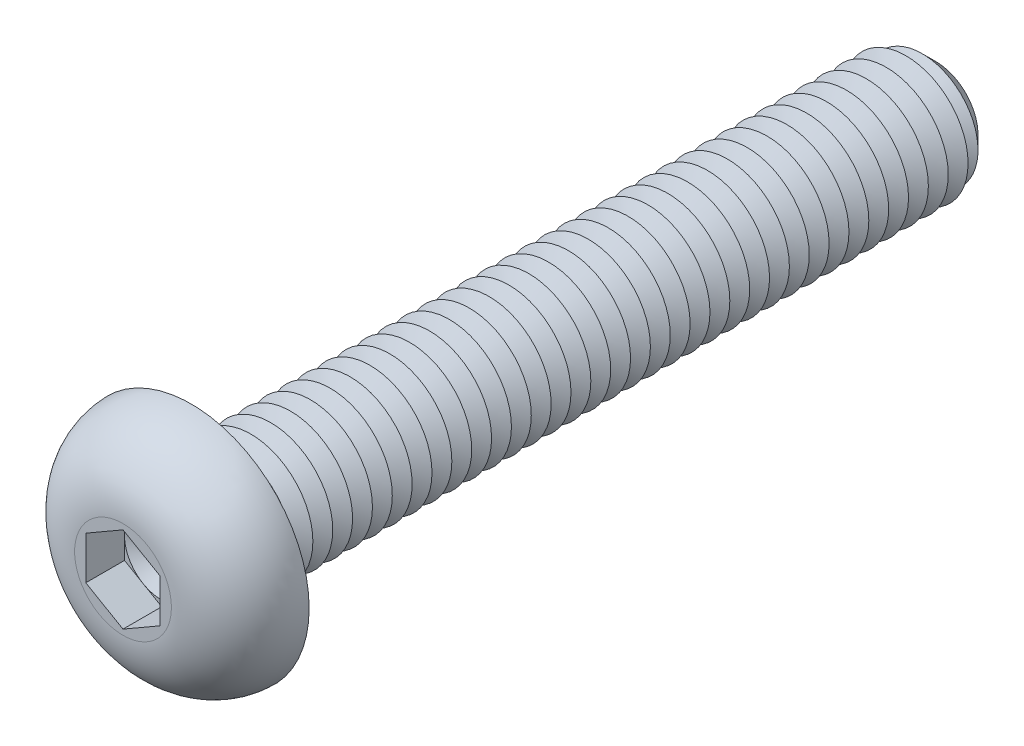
ISO-10303-21;
HEADER;
FILE_DESCRIPTION(('STEP AP214'),'2;1');
FILE_NAME('part.step','',(''),(''),'','','');
FILE_SCHEMA(('AUTOMOTIVE_DESIGN { 1 0 10303 214 1 1 1 1 }'));
ENDSEC;
DATA;
#1=APPLICATION_CONTEXT('core data for automotive mechanical design processes');
#2=APPLICATION_PROTOCOL_DEFINITION('international standard','automotive_design',2000,#1);
#3=PRODUCT_CONTEXT('',#1,'mechanical');
#4=PRODUCT('Part','Part','',(#3));
#5=PRODUCT_RELATED_PRODUCT_CATEGORY('part','',(#4));
#6=PRODUCT_DEFINITION_FORMATION('','',#4);
#7=PRODUCT_DEFINITION_CONTEXT('part definition',#1,'design');
#8=PRODUCT_DEFINITION('design','',#6,#7);
#9=PRODUCT_DEFINITION_SHAPE('','',#8);
#10=(LENGTH_UNIT() NAMED_UNIT(*) SI_UNIT(.MILLI.,.METRE.));
#11=(NAMED_UNIT(*) PLANE_ANGLE_UNIT() SI_UNIT($,.RADIAN.));
#12=(NAMED_UNIT(*) SI_UNIT($,.STERADIAN.) SOLID_ANGLE_UNIT());
#13=UNCERTAINTY_MEASURE_WITH_UNIT(LENGTH_MEASURE(1.E-05),#10,'distance_accuracy_value','');
#14=(GEOMETRIC_REPRESENTATION_CONTEXT(3) GLOBAL_UNCERTAINTY_ASSIGNED_CONTEXT((#13)) GLOBAL_UNIT_ASSIGNED_CONTEXT((#10,
#11,#12)) REPRESENTATION_CONTEXT('',''));
#15=CARTESIAN_POINT('',(0.,0.,0.));
#16=DIRECTION('',(0.,0.,1.));
#17=DIRECTION('',(1.,0.,0.));
#18=AXIS2_PLACEMENT_3D('',#15,#16,#17);
#19=CARTESIAN_POINT('',(0.,0.,1.19));
#20=DIRECTION('',(0.,0.,1.));
#21=DIRECTION('',(1.,0.,0.));
#22=AXIS2_PLACEMENT_3D('',#19,#20,#21);
#23=PLANE('',#22);
#24=CARTESIAN_POINT('',(0.,0.,1.19));
#25=DIRECTION('',(0.,0.,1.));
#26=DIRECTION('',(1.,0.,0.));
#27=AXIS2_PLACEMENT_3D('',#24,#25,#26);
#28=CIRCLE('',#27,1.5);
#29=CARTESIAN_POINT('',(1.5,0.,1.19));
#30=VERTEX_POINT('',#29);
#31=CARTESIAN_POINT('',(0.75,1.29903810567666,1.19));
#32=VERTEX_POINT('',#31);
#33=EDGE_CURVE('E117',#30,#32,#28,.T.);
#34=ORIENTED_EDGE('',*,*,#33,.F.);
#35=DIRECTION('',(0.,1.,0.));
#36=VECTOR('',#35,1.);
#37=CARTESIAN_POINT('',(1.5,-0.866025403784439,1.19));
#38=LINE('',#37,#36);
#39=CARTESIAN_POINT('',(1.5,0.86602540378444,1.19));
#40=VERTEX_POINT('',#39);
#41=EDGE_CURVE('E140',#30,#40,#38,.T.);
#42=ORIENTED_EDGE('',*,*,#41,.T.);
#43=DIRECTION('',(-0.866025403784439,0.5,0.));
#44=VECTOR('',#43,1.);
#45=CARTESIAN_POINT('',(1.5,0.86602540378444,1.19));
#46=LINE('',#45,#44);
#47=EDGE_CURVE('E135',#40,#32,#46,.T.);
#48=ORIENTED_EDGE('',*,*,#47,.T.);
#49=EDGE_LOOP('',(#34,#42,#48));
#50=FACE_BOUND('',#49,.T.);
#51=ADVANCED_FACE('F39',(#50),#23,.T.);
#52=CARTESIAN_POINT('',(0.,0.,1.19));
#53=DIRECTION('',(0.,0.,1.));
#54=DIRECTION('',(1.,0.,0.));
#55=AXIS2_PLACEMENT_3D('',#52,#53,#54);
#56=CIRCLE('',#55,1.5);
#57=CARTESIAN_POINT('',(-0.75,1.29903810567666,1.19));
#58=VERTEX_POINT('',#57);
#59=EDGE_CURVE('E11',#32,#58,#56,.T.);
#60=ORIENTED_EDGE('',*,*,#59,.F.);
#61=CARTESIAN_POINT('',(0.,1.73205080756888,1.19));
#62=VERTEX_POINT('',#61);
#63=EDGE_CURVE('E130',#32,#62,#46,.T.);
#64=ORIENTED_EDGE('',*,*,#63,.T.);
#65=DIRECTION('',(-0.866025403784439,-0.5,0.));
#66=VECTOR('',#65,1.);
#67=CARTESIAN_POINT('',(0.,1.73205080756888,1.19));
#68=LINE('',#67,#66);
#69=EDGE_CURVE('E132',#62,#58,#68,.T.);
#70=ORIENTED_EDGE('',*,*,#69,.T.);
#71=EDGE_LOOP('',(#60,#64,#70));
#72=FACE_BOUND('',#71,.T.);
#73=ADVANCED_FACE('F129',(#72),#23,.T.);
#74=CARTESIAN_POINT('',(-1.5,0.,1.19));
#75=VERTEX_POINT('',#74);
#76=EDGE_CURVE('E49',#58,#75,#56,.T.);
#77=ORIENTED_EDGE('',*,*,#76,.F.);
#78=CARTESIAN_POINT('',(-1.5,0.866025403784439,1.19));
#79=VERTEX_POINT('',#78);
#80=EDGE_CURVE('E143',#58,#79,#68,.T.);
#81=ORIENTED_EDGE('',*,*,#80,.T.);
#82=DIRECTION('',(0.,-1.,0.));
#83=VECTOR('',#82,1.);
#84=CARTESIAN_POINT('',(-1.5,0.866025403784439,1.19));
#85=LINE('',#84,#83);
#86=EDGE_CURVE('E153',#79,#75,#85,.T.);
#87=ORIENTED_EDGE('',*,*,#86,.T.);
#88=EDGE_LOOP('',(#77,#81,#87));
#89=FACE_BOUND('',#88,.T.);
#90=ADVANCED_FACE('F258',(#89),#23,.T.);
#91=CARTESIAN_POINT('',(-0.75,-1.29903810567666,1.19));
#92=VERTEX_POINT('',#91);
#93=EDGE_CURVE('E238',#75,#92,#56,.T.);
#94=ORIENTED_EDGE('',*,*,#93,.F.);
#95=CARTESIAN_POINT('',(-1.5,-0.866025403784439,1.19));
#96=VERTEX_POINT('',#95);
#97=EDGE_CURVE('E152',#75,#96,#85,.T.);
#98=ORIENTED_EDGE('',*,*,#97,.T.);
#99=DIRECTION('',(0.866025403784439,-0.5,0.));
#100=VECTOR('',#99,1.);
#101=CARTESIAN_POINT('',(-1.5,-0.866025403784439,1.19));
#102=LINE('',#101,#100);
#103=EDGE_CURVE('E158',#96,#92,#102,.T.);
#104=ORIENTED_EDGE('',*,*,#103,.T.);
#105=EDGE_LOOP('',(#94,#98,#104));
#106=FACE_BOUND('',#105,.T.);
#107=ADVANCED_FACE('F251',(#106),#23,.T.);
#108=CARTESIAN_POINT('',(0.75,-1.29903810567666,1.19));
#109=VERTEX_POINT('',#108);
#110=EDGE_CURVE('E56',#92,#109,#56,.T.);
#111=ORIENTED_EDGE('',*,*,#110,.F.);
#112=CARTESIAN_POINT('',(0.,-1.73205080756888,1.19));
#113=VERTEX_POINT('',#112);
#114=EDGE_CURVE('E157',#92,#113,#102,.T.);
#115=ORIENTED_EDGE('',*,*,#114,.T.);
#116=DIRECTION('',(0.866025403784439,0.5,0.));
#117=VECTOR('',#116,1.);
#118=CARTESIAN_POINT('',(0.,-1.73205080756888,1.19));
#119=LINE('',#118,#117);
#120=EDGE_CURVE('E163',#113,#109,#119,.T.);
#121=ORIENTED_EDGE('',*,*,#120,.T.);
#122=EDGE_LOOP('',(#111,#115,#121));
#123=FACE_BOUND('',#122,.T.);
#124=ADVANCED_FACE('F381',(#123),#23,.T.);
#125=CARTESIAN_POINT('',(0.,0.,-30.));
#126=DIRECTION('',(0.,0.,1.));
#127=DIRECTION('',(1.,0.,0.));
#128=AXIS2_PLACEMENT_3D('',#125,#126,#127);
#129=CYLINDRICAL_SURFACE('',#128,2.5);
#130=CARTESIAN_POINT('',(0.,0.,-0.400000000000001));
#131=DIRECTION('',(0.,0.,1.));
#132=DIRECTION('',(1.,0.,0.));
#133=AXIS2_PLACEMENT_3D('',#130,#131,#132);
#134=CIRCLE('',#133,2.5);
#135=CARTESIAN_POINT('',(2.5,0.,-0.400000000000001));
#136=VERTEX_POINT('',#135);
#137=EDGE_CURVE('E221',#136,#136,#134,.F.);
#138=ORIENTED_EDGE('',*,*,#137,.T.);
#139=EDGE_LOOP('',(#138));
#140=FACE_BOUND('',#139,.T.);
#141=CARTESIAN_POINT('',(0.,0.,-0.800000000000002));
#142=DIRECTION('',(0.,0.,1.));
#143=DIRECTION('',(1.,0.,0.));
#144=AXIS2_PLACEMENT_3D('',#141,#142,#143);
#145=CIRCLE('',#144,2.5);
#146=CARTESIAN_POINT('',(2.5,0.,-0.800000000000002));
#147=VERTEX_POINT('',#146);
#148=EDGE_CURVE('E148',#147,#147,#145,.T.);
#149=ORIENTED_EDGE('',*,*,#148,.T.);
#150=EDGE_LOOP('',(#149));
#151=FACE_BOUND('',#150,.T.);
#152=ADVANCED_FACE('F365',(#140,#151),#129,.T.);
#153=CARTESIAN_POINT('',(0.,4.75,0.));
#154=DIRECTION('',(0.,0.,1.));
#155=DIRECTION('',(1.,0.,0.));
#156=AXIS2_PLACEMENT_3D('',#153,#154,#155);
#157=PLANE('',#156);
#158=CARTESIAN_POINT('',(0.,0.,0.));
#159=DIRECTION('',(0.,0.,1.));
#160=DIRECTION('',(1.,0.,0.));
#161=AXIS2_PLACEMENT_3D('',#158,#159,#160);
#162=CIRCLE('',#161,2.9);
#163=CARTESIAN_POINT('',(2.9,0.,0.));
#164=VERTEX_POINT('',#163);
#165=EDGE_CURVE('E230',#164,#164,#162,.T.);
#166=ORIENTED_EDGE('',*,*,#165,.T.);
#167=EDGE_LOOP('',(#166));
#168=FACE_BOUND('',#167,.T.);
#169=CARTESIAN_POINT('',(0.,0.,0.));
#170=DIRECTION('',(0.,0.,1.));
#171=DIRECTION('',(1.,0.,0.));
#172=AXIS2_PLACEMENT_3D('',#169,#170,#171);
#173=CIRCLE('',#172,4.75);
#174=CARTESIAN_POINT('',(4.75,0.,0.));
#175=VERTEX_POINT('',#174);
#176=EDGE_CURVE('E195',#175,#175,#173,.T.);
#177=ORIENTED_EDGE('',*,*,#176,.F.);
#178=EDGE_LOOP('',(#177));
#179=FACE_BOUND('',#178,.T.);
#180=ADVANCED_FACE('F411',(#168,#179),#157,.F.);
#181=CARTESIAN_POINT('',(0.,0.,2.75));
#182=DIRECTION('',(0.,0.,-1.));
#183=DIRECTION('',(-1.,0.,0.));
#184=AXIS2_PLACEMENT_3D('',#181,#182,#183);
#185=PLANE('',#184);
#186=DIRECTION('',(-0.866025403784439,-0.5,0.));
#187=VECTOR('',#186,1.);
#188=CARTESIAN_POINT('',(0.,1.73205080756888,2.75));
#189=LINE('',#188,#187);
#190=CARTESIAN_POINT('',(0.,1.73205080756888,2.75));
#191=VERTEX_POINT('',#190);
#192=CARTESIAN_POINT('',(-1.5,0.866025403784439,2.75));
#193=VERTEX_POINT('',#192);
#194=EDGE_CURVE('E173',#191,#193,#189,.T.);
#195=ORIENTED_EDGE('',*,*,#194,.F.);
#196=DIRECTION('',(-0.866025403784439,0.5,0.));
#197=VECTOR('',#196,1.);
#198=CARTESIAN_POINT('',(1.5,0.86602540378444,2.75));
#199=LINE('',#198,#197);
#200=CARTESIAN_POINT('',(1.5,0.86602540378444,2.75));
#201=VERTEX_POINT('',#200);
#202=EDGE_CURVE('E64',#201,#191,#199,.T.);
#203=ORIENTED_EDGE('',*,*,#202,.F.);
#204=DIRECTION('',(0.,1.,0.));
#205=VECTOR('',#204,1.);
#206=CARTESIAN_POINT('',(1.5,-0.866025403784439,2.75));
#207=LINE('',#206,#205);
#208=CARTESIAN_POINT('',(1.5,-0.866025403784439,2.75));
#209=VERTEX_POINT('',#208);
#210=EDGE_CURVE('E138',#209,#201,#207,.T.);
#211=ORIENTED_EDGE('',*,*,#210,.F.);
#212=DIRECTION('',(0.866025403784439,0.5,0.));
#213=VECTOR('',#212,1.);
#214=CARTESIAN_POINT('',(0.,-1.73205080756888,2.75));
#215=LINE('',#214,#213);
#216=CARTESIAN_POINT('',(0.,-1.73205080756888,2.75));
#217=VERTEX_POINT('',#216);
#218=EDGE_CURVE('E185',#217,#209,#215,.T.);
#219=ORIENTED_EDGE('',*,*,#218,.F.);
#220=DIRECTION('',(0.866025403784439,-0.5,0.));
#221=VECTOR('',#220,1.);
#222=CARTESIAN_POINT('',(-1.5,-0.866025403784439,2.75));
#223=LINE('',#222,#221);
#224=CARTESIAN_POINT('',(-1.5,-0.866025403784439,2.75));
#225=VERTEX_POINT('',#224);
#226=EDGE_CURVE('E181',#225,#217,#223,.T.);
#227=ORIENTED_EDGE('',*,*,#226,.F.);
#228=DIRECTION('',(0.,-1.,0.));
#229=VECTOR('',#228,1.);
#230=CARTESIAN_POINT('',(-1.5,0.866025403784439,2.75));
#231=LINE('',#230,#229);
#232=EDGE_CURVE('E177',#193,#225,#231,.T.);
#233=ORIENTED_EDGE('',*,*,#232,.F.);
#234=EDGE_LOOP('',(#195,#203,#211,#219,#227,#233));
#235=FACE_BOUND('',#234,.T.);
#236=CARTESIAN_POINT('',(0.,0.,2.75));
#237=DIRECTION('',(0.,0.,1.));
#238=DIRECTION('',(1.,0.,0.));
#239=AXIS2_PLACEMENT_3D('',#236,#237,#238);
#240=CIRCLE('',#239,1.95044646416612);
#241=CARTESIAN_POINT('',(1.95044646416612,0.,2.75));
#242=VERTEX_POINT('',#241);
#243=EDGE_CURVE('E213',#242,#242,#240,.T.);
#244=ORIENTED_EDGE('',*,*,#243,.T.);
#245=EDGE_LOOP('',(#244));
#246=FACE_BOUND('',#245,.T.);
#247=ADVANCED_FACE('F267',(#235,#246),#185,.F.);
#248=CARTESIAN_POINT('',(0.,0.,-0.0500000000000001));
#249=DIRECTION('',(0.,0.,1.));
#250=DIRECTION('',(1.,0.,0.));
#251=AXIS2_PLACEMENT_3D('',#248,#249,#250);
#252=DEGENERATE_TOROIDAL_SURFACE('',#251,1.95044646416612,2.8,.T.);
#253=ORIENTED_EDGE('',*,*,#243,.F.);
#254=EDGE_LOOP('',(#253));
#255=FACE_BOUND('',#254,.T.);
#256=ORIENTED_EDGE('',*,*,#176,.T.);
#257=EDGE_LOOP('',(#256));
#258=FACE_BOUND('',#257,.T.);
#259=ADVANCED_FACE('F405',(#255,#258),#252,.T.);
#260=CARTESIAN_POINT('',(1.5,0.86602540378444,1.19));
#261=DIRECTION('',(0.5,0.866025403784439,0.));
#262=DIRECTION('',(-0.866025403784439,0.5,0.));
#263=AXIS2_PLACEMENT_3D('',#260,#261,#262);
#264=PLANE('',#263);
#265=ORIENTED_EDGE('',*,*,#202,.T.);
#266=DIRECTION('',(0.,0.,1.));
#267=VECTOR('',#266,1.);
#268=CARTESIAN_POINT('',(0.,1.73205080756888,1.19));
#269=LINE('',#268,#267);
#270=EDGE_CURVE('E136',#62,#191,#269,.T.);
#271=ORIENTED_EDGE('',*,*,#270,.F.);
#272=ORIENTED_EDGE('',*,*,#63,.F.);
#273=ORIENTED_EDGE('',*,*,#47,.F.);
#274=DIRECTION('',(0.,0.,1.));
#275=VECTOR('',#274,1.);
#276=CARTESIAN_POINT('',(1.5,0.86602540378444,1.19));
#277=LINE('',#276,#275);
#278=EDGE_CURVE('E192',#40,#201,#277,.T.);
#279=ORIENTED_EDGE('',*,*,#278,.T.);
#280=EDGE_LOOP('',(#265,#271,#272,#273,#279));
#281=FACE_BOUND('',#280,.T.);
#282=ADVANCED_FACE('F134',(#281),#264,.F.);
#283=CARTESIAN_POINT('',(1.5,-0.866025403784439,1.19));
#284=DIRECTION('',(1.,0.,0.));
#285=DIRECTION('',(0.,1.,0.));
#286=AXIS2_PLACEMENT_3D('',#283,#284,#285);
#287=PLANE('',#286);
#288=ORIENTED_EDGE('',*,*,#210,.T.);
#289=ORIENTED_EDGE('',*,*,#278,.F.);
#290=ORIENTED_EDGE('',*,*,#41,.F.);
#291=CARTESIAN_POINT('',(1.5,-0.866025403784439,1.19));
#292=VERTEX_POINT('',#291);
#293=EDGE_CURVE('E167',#292,#30,#38,.T.);
#294=ORIENTED_EDGE('',*,*,#293,.F.);
#295=DIRECTION('',(0.,0.,1.));
#296=VECTOR('',#295,1.);
#297=CARTESIAN_POINT('',(1.5,-0.866025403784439,1.19));
#298=LINE('',#297,#296);
#299=EDGE_CURVE('E196',#292,#209,#298,.T.);
#300=ORIENTED_EDGE('',*,*,#299,.T.);
#301=EDGE_LOOP('',(#288,#289,#290,#294,#300));
#302=FACE_BOUND('',#301,.T.);
#303=ADVANCED_FACE('F389',(#302),#287,.F.);
#304=CARTESIAN_POINT('',(0.,-1.73205080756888,1.19));
#305=DIRECTION('',(0.5,-0.866025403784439,0.));
#306=DIRECTION('',(0.866025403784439,0.5,0.));
#307=AXIS2_PLACEMENT_3D('',#304,#305,#306);
#308=PLANE('',#307);
#309=ORIENTED_EDGE('',*,*,#218,.T.);
#310=ORIENTED_EDGE('',*,*,#299,.F.);
#311=EDGE_CURVE('E162',#109,#292,#119,.T.);
#312=ORIENTED_EDGE('',*,*,#311,.F.);
#313=ORIENTED_EDGE('',*,*,#120,.F.);
#314=DIRECTION('',(0.,0.,1.));
#315=VECTOR('',#314,1.);
#316=CARTESIAN_POINT('',(0.,-1.73205080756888,1.19));
#317=LINE('',#316,#315);
#318=EDGE_CURVE('E199',#113,#217,#317,.T.);
#319=ORIENTED_EDGE('',*,*,#318,.T.);
#320=EDGE_LOOP('',(#309,#310,#312,#313,#319));
#321=FACE_BOUND('',#320,.T.);
#322=ADVANCED_FACE('F392',(#321),#308,.F.);
#323=CARTESIAN_POINT('',(-1.5,-0.866025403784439,1.19));
#324=DIRECTION('',(-0.5,-0.866025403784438,0.));
#325=DIRECTION('',(0.866025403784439,-0.5,0.));
#326=AXIS2_PLACEMENT_3D('',#323,#324,#325);
#327=PLANE('',#326);
#328=ORIENTED_EDGE('',*,*,#226,.T.);
#329=ORIENTED_EDGE('',*,*,#318,.F.);
#330=ORIENTED_EDGE('',*,*,#114,.F.);
#331=ORIENTED_EDGE('',*,*,#103,.F.);
#332=DIRECTION('',(0.,0.,1.));
#333=VECTOR('',#332,1.);
#334=CARTESIAN_POINT('',(-1.5,-0.866025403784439,1.19));
#335=LINE('',#334,#333);
#336=EDGE_CURVE('E202',#96,#225,#335,.T.);
#337=ORIENTED_EDGE('',*,*,#336,.T.);
#338=EDGE_LOOP('',(#328,#329,#330,#331,#337));
#339=FACE_BOUND('',#338,.T.);
#340=ADVANCED_FACE('F272',(#339),#327,.F.);
#341=CARTESIAN_POINT('',(-1.5,0.866025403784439,1.19));
#342=DIRECTION('',(-1.,0.,0.));
#343=DIRECTION('',(0.,-1.,0.));
#344=AXIS2_PLACEMENT_3D('',#341,#342,#343);
#345=PLANE('',#344);
#346=ORIENTED_EDGE('',*,*,#232,.T.);
#347=ORIENTED_EDGE('',*,*,#336,.F.);
#348=ORIENTED_EDGE('',*,*,#97,.F.);
#349=ORIENTED_EDGE('',*,*,#86,.F.);
#350=DIRECTION('',(0.,0.,1.));
#351=VECTOR('',#350,1.);
#352=CARTESIAN_POINT('',(-1.5,0.866025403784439,1.19));
#353=LINE('',#352,#351);
#354=EDGE_CURVE('E205',#79,#193,#353,.T.);
#355=ORIENTED_EDGE('',*,*,#354,.T.);
#356=EDGE_LOOP('',(#346,#347,#348,#349,#355));
#357=FACE_BOUND('',#356,.T.);
#358=ADVANCED_FACE('F256',(#357),#345,.F.);
#359=CARTESIAN_POINT('',(0.,1.73205080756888,1.19));
#360=DIRECTION('',(-0.5,0.866025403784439,0.));
#361=DIRECTION('',(-0.866025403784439,-0.5,0.));
#362=AXIS2_PLACEMENT_3D('',#359,#360,#361);
#363=PLANE('',#362);
#364=ORIENTED_EDGE('',*,*,#194,.T.);
#365=ORIENTED_EDGE('',*,*,#354,.F.);
#366=ORIENTED_EDGE('',*,*,#80,.F.);
#367=ORIENTED_EDGE('',*,*,#69,.F.);
#368=ORIENTED_EDGE('',*,*,#270,.T.);
#369=EDGE_LOOP('',(#364,#365,#366,#367,#368));
#370=FACE_BOUND('',#369,.T.);
#371=ADVANCED_FACE('F261',(#370),#363,.F.);
#372=EDGE_CURVE('E43',#109,#30,#56,.T.);
#373=ORIENTED_EDGE('',*,*,#372,.F.);
#374=ORIENTED_EDGE('',*,*,#311,.T.);
#375=ORIENTED_EDGE('',*,*,#293,.T.);
#376=EDGE_LOOP('',(#373,#374,#375));
#377=FACE_BOUND('',#376,.T.);
#378=ADVANCED_FACE('F370',(#377),#23,.T.);
#379=CARTESIAN_POINT('',(0.,0.,-0.800000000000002));
#380=DIRECTION('',(0.,0.,1.));
#381=DIRECTION('',(1.,0.,0.));
#382=AXIS2_PLACEMENT_3D('',#379,#380,#381);
#383=CONICAL_SURFACE('',#382,2.5,1.0471975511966);
#384=CARTESIAN_POINT('',(0.,0.,-1.2));
#385=DIRECTION('',(0.,0.,1.));
#386=DIRECTION('',(1.,0.,0.));
#387=AXIS2_PLACEMENT_3D('',#384,#385,#386);
#388=CIRCLE('',#387,1.80717967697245);
#389=CARTESIAN_POINT('',(1.80717967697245,0.,-1.2));
#390=VERTEX_POINT('',#389);
#391=EDGE_CURVE('E356',#390,#390,#388,.T.);
#392=ORIENTED_EDGE('',*,*,#391,.T.);
#393=EDGE_LOOP('',(#392));
#394=FACE_BOUND('',#393,.T.);
#395=ORIENTED_EDGE('',*,*,#148,.F.);
#396=EDGE_LOOP('',(#395));
#397=FACE_BOUND('',#396,.T.);
#398=ADVANCED_FACE('F367',(#394,#397),#383,.T.);
#399=CARTESIAN_POINT('',(0.,0.,-1.2));
#400=DIRECTION('',(0.,0.,-1.));
#401=DIRECTION('',(-1.,0.,0.));
#402=AXIS2_PLACEMENT_3D('',#399,#400,#401);
#403=CONICAL_SURFACE('',#402,1.80717967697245,1.04719755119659);
#404=CARTESIAN_POINT('',(0.,0.,-1.6));
#405=DIRECTION('',(0.,0.,1.));
#406=DIRECTION('',(1.,0.,0.));
#407=AXIS2_PLACEMENT_3D('',#404,#405,#406);
#408=CIRCLE('',#407,2.5);
#409=CARTESIAN_POINT('',(2.5,0.,-1.6));
#410=VERTEX_POINT('',#409);
#411=EDGE_CURVE('E353',#410,#410,#408,.T.);
#412=ORIENTED_EDGE('',*,*,#411,.T.);
#413=EDGE_LOOP('',(#412));
#414=FACE_BOUND('',#413,.T.);
#415=ORIENTED_EDGE('',*,*,#391,.F.);
#416=EDGE_LOOP('',(#415));
#417=FACE_BOUND('',#416,.T.);
#418=ADVANCED_FACE('F369',(#414,#417),#403,.T.);
#419=CARTESIAN_POINT('',(0.,0.,-1.6));
#420=DIRECTION('',(0.,0.,1.));
#421=DIRECTION('',(1.,0.,0.));
#422=AXIS2_PLACEMENT_3D('',#419,#420,#421);
#423=CONICAL_SURFACE('',#422,2.5,1.0471975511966);
#424=CARTESIAN_POINT('',(0.,0.,-2.));
#425=DIRECTION('',(0.,0.,1.));
#426=DIRECTION('',(1.,0.,0.));
#427=AXIS2_PLACEMENT_3D('',#424,#425,#426);
#428=CIRCLE('',#427,1.80717967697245);
#429=CARTESIAN_POINT('',(1.80717967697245,0.,-2.));
#430=VERTEX_POINT('',#429);
#431=EDGE_CURVE('E349',#430,#430,#428,.T.);
#432=ORIENTED_EDGE('',*,*,#431,.T.);
#433=EDGE_LOOP('',(#432));
#434=FACE_BOUND('',#433,.T.);
#435=ORIENTED_EDGE('',*,*,#411,.F.);
#436=EDGE_LOOP('',(#435));
#437=FACE_BOUND('',#436,.T.);
#438=ADVANCED_FACE('F376',(#434,#437),#423,.T.);
#439=CARTESIAN_POINT('',(0.,0.,-2.));
#440=DIRECTION('',(0.,0.,-1.));
#441=DIRECTION('',(-1.,0.,0.));
#442=AXIS2_PLACEMENT_3D('',#439,#440,#441);
#443=CONICAL_SURFACE('',#442,1.80717967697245,1.04719755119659);
#444=CARTESIAN_POINT('',(0.,0.,-2.4));
#445=DIRECTION('',(0.,0.,1.));
#446=DIRECTION('',(1.,0.,0.));
#447=AXIS2_PLACEMENT_3D('',#444,#445,#446);
#448=CIRCLE('',#447,2.5);
#449=CARTESIAN_POINT('',(2.5,0.,-2.4));
#450=VERTEX_POINT('',#449);
#451=EDGE_CURVE('E345',#450,#450,#448,.T.);
#452=ORIENTED_EDGE('',*,*,#451,.T.);
#453=EDGE_LOOP('',(#452));
#454=FACE_BOUND('',#453,.T.);
#455=ORIENTED_EDGE('',*,*,#431,.F.);
#456=EDGE_LOOP('',(#455));
#457=FACE_BOUND('',#456,.T.);
#458=ADVANCED_FACE('F705',(#454,#457),#443,.T.);
#459=CARTESIAN_POINT('',(0.,0.,-2.4));
#460=DIRECTION('',(0.,0.,1.));
#461=DIRECTION('',(1.,0.,0.));
#462=AXIS2_PLACEMENT_3D('',#459,#460,#461);
#463=CONICAL_SURFACE('',#462,2.5,1.0471975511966);
#464=CARTESIAN_POINT('',(0.,0.,-2.8));
#465=DIRECTION('',(0.,0.,1.));
#466=DIRECTION('',(1.,0.,0.));
#467=AXIS2_PLACEMENT_3D('',#464,#465,#466);
#468=CIRCLE('',#467,1.80717967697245);
#469=CARTESIAN_POINT('',(1.80717967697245,0.,-2.8));
#470=VERTEX_POINT('',#469);
#471=EDGE_CURVE('E341',#470,#470,#468,.T.);
#472=ORIENTED_EDGE('',*,*,#471,.T.);
#473=EDGE_LOOP('',(#472));
#474=FACE_BOUND('',#473,.T.);
#475=ORIENTED_EDGE('',*,*,#451,.F.);
#476=EDGE_LOOP('',(#475));
#477=FACE_BOUND('',#476,.T.);
#478=ADVANCED_FACE('F701',(#474,#477),#463,.T.);
#479=CARTESIAN_POINT('',(0.,0.,-2.8));
#480=DIRECTION('',(0.,0.,-1.));
#481=DIRECTION('',(-1.,0.,0.));
#482=AXIS2_PLACEMENT_3D('',#479,#480,#481);
#483=CONICAL_SURFACE('',#482,1.80717967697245,1.04719755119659);
#484=CARTESIAN_POINT('',(0.,0.,-3.2));
#485=DIRECTION('',(0.,0.,1.));
#486=DIRECTION('',(1.,0.,0.));
#487=AXIS2_PLACEMENT_3D('',#484,#485,#486);
#488=CIRCLE('',#487,2.5);
#489=CARTESIAN_POINT('',(2.5,0.,-3.2));
#490=VERTEX_POINT('',#489);
#491=EDGE_CURVE('E337',#490,#490,#488,.T.);
#492=ORIENTED_EDGE('',*,*,#491,.T.);
#493=EDGE_LOOP('',(#492));
#494=FACE_BOUND('',#493,.T.);
#495=ORIENTED_EDGE('',*,*,#471,.F.);
#496=EDGE_LOOP('',(#495));
#497=FACE_BOUND('',#496,.T.);
#498=ADVANCED_FACE('F697',(#494,#497),#483,.T.);
#499=CARTESIAN_POINT('',(0.,0.,-3.2));
#500=DIRECTION('',(0.,0.,1.));
#501=DIRECTION('',(1.,0.,0.));
#502=AXIS2_PLACEMENT_3D('',#499,#500,#501);
#503=CONICAL_SURFACE('',#502,2.5,1.0471975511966);
#504=CARTESIAN_POINT('',(0.,0.,-3.6));
#505=DIRECTION('',(0.,0.,1.));
#506=DIRECTION('',(1.,0.,0.));
#507=AXIS2_PLACEMENT_3D('',#504,#505,#506);
#508=CIRCLE('',#507,1.80717967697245);
#509=CARTESIAN_POINT('',(1.80717967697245,0.,-3.6));
#510=VERTEX_POINT('',#509);
#511=EDGE_CURVE('E333',#510,#510,#508,.T.);
#512=ORIENTED_EDGE('',*,*,#511,.T.);
#513=EDGE_LOOP('',(#512));
#514=FACE_BOUND('',#513,.T.);
#515=ORIENTED_EDGE('',*,*,#491,.F.);
#516=EDGE_LOOP('',(#515));
#517=FACE_BOUND('',#516,.T.);
#518=ADVANCED_FACE('F693',(#514,#517),#503,.T.);
#519=CARTESIAN_POINT('',(0.,0.,-3.6));
#520=DIRECTION('',(0.,0.,-1.));
#521=DIRECTION('',(-1.,0.,0.));
#522=AXIS2_PLACEMENT_3D('',#519,#520,#521);
#523=CONICAL_SURFACE('',#522,1.80717967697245,1.04719755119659);
#524=CARTESIAN_POINT('',(0.,0.,-4.));
#525=DIRECTION('',(0.,0.,1.));
#526=DIRECTION('',(1.,0.,0.));
#527=AXIS2_PLACEMENT_3D('',#524,#525,#526);
#528=CIRCLE('',#527,2.5);
#529=CARTESIAN_POINT('',(2.5,0.,-4.));
#530=VERTEX_POINT('',#529);
#531=EDGE_CURVE('E329',#530,#530,#528,.T.);
#532=ORIENTED_EDGE('',*,*,#531,.T.);
#533=EDGE_LOOP('',(#532));
#534=FACE_BOUND('',#533,.T.);
#535=ORIENTED_EDGE('',*,*,#511,.F.);
#536=EDGE_LOOP('',(#535));
#537=FACE_BOUND('',#536,.T.);
#538=ADVANCED_FACE('F689',(#534,#537),#523,.T.);
#539=CARTESIAN_POINT('',(0.,0.,-4.));
#540=DIRECTION('',(0.,0.,1.));
#541=DIRECTION('',(1.,0.,0.));
#542=AXIS2_PLACEMENT_3D('',#539,#540,#541);
#543=CONICAL_SURFACE('',#542,2.5,1.0471975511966);
#544=CARTESIAN_POINT('',(0.,0.,-4.4));
#545=DIRECTION('',(0.,0.,1.));
#546=DIRECTION('',(1.,0.,0.));
#547=AXIS2_PLACEMENT_3D('',#544,#545,#546);
#548=CIRCLE('',#547,1.80717967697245);
#549=CARTESIAN_POINT('',(1.80717967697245,0.,-4.4));
#550=VERTEX_POINT('',#549);
#551=EDGE_CURVE('E325',#550,#550,#548,.T.);
#552=ORIENTED_EDGE('',*,*,#551,.T.);
#553=EDGE_LOOP('',(#552));
#554=FACE_BOUND('',#553,.T.);
#555=ORIENTED_EDGE('',*,*,#531,.F.);
#556=EDGE_LOOP('',(#555));
#557=FACE_BOUND('',#556,.T.);
#558=ADVANCED_FACE('F685',(#554,#557),#543,.T.);
#559=CARTESIAN_POINT('',(0.,0.,-4.4));
#560=DIRECTION('',(0.,0.,-1.));
#561=DIRECTION('',(-1.,0.,0.));
#562=AXIS2_PLACEMENT_3D('',#559,#560,#561);
#563=CONICAL_SURFACE('',#562,1.80717967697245,1.04719755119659);
#564=CARTESIAN_POINT('',(0.,0.,-4.8));
#565=DIRECTION('',(0.,0.,1.));
#566=DIRECTION('',(1.,0.,0.));
#567=AXIS2_PLACEMENT_3D('',#564,#565,#566);
#568=CIRCLE('',#567,2.5);
#569=CARTESIAN_POINT('',(2.5,0.,-4.8));
#570=VERTEX_POINT('',#569);
#571=EDGE_CURVE('E322',#570,#570,#568,.T.);
#572=ORIENTED_EDGE('',*,*,#571,.T.);
#573=EDGE_LOOP('',(#572));
#574=FACE_BOUND('',#573,.T.);
#575=ORIENTED_EDGE('',*,*,#551,.F.);
#576=EDGE_LOOP('',(#575));
#577=FACE_BOUND('',#576,.T.);
#578=ADVANCED_FACE('F681',(#574,#577),#563,.T.);
#579=CARTESIAN_POINT('',(0.,0.,-4.8));
#580=DIRECTION('',(0.,0.,1.));
#581=DIRECTION('',(1.,0.,0.));
#582=AXIS2_PLACEMENT_3D('',#579,#580,#581);
#583=CONICAL_SURFACE('',#582,2.5,1.0471975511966);
#584=CARTESIAN_POINT('',(0.,0.,-5.2));
#585=DIRECTION('',(0.,0.,1.));
#586=DIRECTION('',(1.,0.,0.));
#587=AXIS2_PLACEMENT_3D('',#584,#585,#586);
#588=CIRCLE('',#587,1.80717967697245);
#589=CARTESIAN_POINT('',(1.80717967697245,0.,-5.2));
#590=VERTEX_POINT('',#589);
#591=EDGE_CURVE('E319',#590,#590,#588,.T.);
#592=ORIENTED_EDGE('',*,*,#591,.T.);
#593=EDGE_LOOP('',(#592));
#594=FACE_BOUND('',#593,.T.);
#595=ORIENTED_EDGE('',*,*,#571,.F.);
#596=EDGE_LOOP('',(#595));
#597=FACE_BOUND('',#596,.T.);
#598=ADVANCED_FACE('F677',(#594,#597),#583,.T.);
#599=CARTESIAN_POINT('',(0.,0.,-5.2));
#600=DIRECTION('',(0.,0.,-1.));
#601=DIRECTION('',(-1.,0.,0.));
#602=AXIS2_PLACEMENT_3D('',#599,#600,#601);
#603=CONICAL_SURFACE('',#602,1.80717967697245,1.04719755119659);
#604=CARTESIAN_POINT('',(0.,0.,-5.6));
#605=DIRECTION('',(0.,0.,1.));
#606=DIRECTION('',(1.,0.,0.));
#607=AXIS2_PLACEMENT_3D('',#604,#605,#606);
#608=CIRCLE('',#607,2.5);
#609=CARTESIAN_POINT('',(2.5,0.,-5.6));
#610=VERTEX_POINT('',#609);
#611=EDGE_CURVE('E315',#610,#610,#608,.T.);
#612=ORIENTED_EDGE('',*,*,#611,.T.);
#613=EDGE_LOOP('',(#612));
#614=FACE_BOUND('',#613,.T.);
#615=ORIENTED_EDGE('',*,*,#591,.F.);
#616=EDGE_LOOP('',(#615));
#617=FACE_BOUND('',#616,.T.);
#618=ADVANCED_FACE('F673',(#614,#617),#603,.T.);
#619=CARTESIAN_POINT('',(0.,0.,-5.6));
#620=DIRECTION('',(0.,0.,1.));
#621=DIRECTION('',(1.,0.,0.));
#622=AXIS2_PLACEMENT_3D('',#619,#620,#621);
#623=CONICAL_SURFACE('',#622,2.5,1.0471975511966);
#624=CARTESIAN_POINT('',(0.,0.,-6.));
#625=DIRECTION('',(0.,0.,1.));
#626=DIRECTION('',(1.,0.,0.));
#627=AXIS2_PLACEMENT_3D('',#624,#625,#626);
#628=CIRCLE('',#627,1.80717967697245);
#629=CARTESIAN_POINT('',(1.80717967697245,0.,-6.));
#630=VERTEX_POINT('',#629);
#631=EDGE_CURVE('E312',#630,#630,#628,.T.);
#632=ORIENTED_EDGE('',*,*,#631,.T.);
#633=EDGE_LOOP('',(#632));
#634=FACE_BOUND('',#633,.T.);
#635=ORIENTED_EDGE('',*,*,#611,.F.);
#636=EDGE_LOOP('',(#635));
#637=FACE_BOUND('',#636,.T.);
#638=ADVANCED_FACE('F669',(#634,#637),#623,.T.);
#639=CARTESIAN_POINT('',(0.,0.,-6.));
#640=DIRECTION('',(0.,0.,-1.));
#641=DIRECTION('',(-1.,0.,0.));
#642=AXIS2_PLACEMENT_3D('',#639,#640,#641);
#643=CONICAL_SURFACE('',#642,1.80717967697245,1.04719755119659);
#644=CARTESIAN_POINT('',(0.,0.,-6.4));
#645=DIRECTION('',(0.,0.,1.));
#646=DIRECTION('',(1.,0.,0.));
#647=AXIS2_PLACEMENT_3D('',#644,#645,#646);
#648=CIRCLE('',#647,2.5);
#649=CARTESIAN_POINT('',(2.5,0.,-6.4));
#650=VERTEX_POINT('',#649);
#651=EDGE_CURVE('E308',#650,#650,#648,.T.);
#652=ORIENTED_EDGE('',*,*,#651,.T.);
#653=EDGE_LOOP('',(#652));
#654=FACE_BOUND('',#653,.T.);
#655=ORIENTED_EDGE('',*,*,#631,.F.);
#656=EDGE_LOOP('',(#655));
#657=FACE_BOUND('',#656,.T.);
#658=ADVANCED_FACE('F665',(#654,#657),#643,.T.);
#659=CARTESIAN_POINT('',(0.,0.,-6.4));
#660=DIRECTION('',(0.,0.,1.));
#661=DIRECTION('',(1.,0.,0.));
#662=AXIS2_PLACEMENT_3D('',#659,#660,#661);
#663=CONICAL_SURFACE('',#662,2.5,1.0471975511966);
#664=CARTESIAN_POINT('',(0.,0.,-6.8));
#665=DIRECTION('',(0.,0.,1.));
#666=DIRECTION('',(1.,0.,0.));
#667=AXIS2_PLACEMENT_3D('',#664,#665,#666);
#668=CIRCLE('',#667,1.80717967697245);
#669=CARTESIAN_POINT('',(1.80717967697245,0.,-6.8));
#670=VERTEX_POINT('',#669);
#671=EDGE_CURVE('E304',#670,#670,#668,.T.);
#672=ORIENTED_EDGE('',*,*,#671,.T.);
#673=EDGE_LOOP('',(#672));
#674=FACE_BOUND('',#673,.T.);
#675=ORIENTED_EDGE('',*,*,#651,.F.);
#676=EDGE_LOOP('',(#675));
#677=FACE_BOUND('',#676,.T.);
#678=ADVANCED_FACE('F661',(#674,#677),#663,.T.);
#679=CARTESIAN_POINT('',(0.,0.,-6.8));
#680=DIRECTION('',(0.,0.,-1.));
#681=DIRECTION('',(-1.,0.,0.));
#682=AXIS2_PLACEMENT_3D('',#679,#680,#681);
#683=CONICAL_SURFACE('',#682,1.80717967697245,1.04719755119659);
#684=CARTESIAN_POINT('',(0.,0.,-7.2));
#685=DIRECTION('',(0.,0.,1.));
#686=DIRECTION('',(1.,0.,0.));
#687=AXIS2_PLACEMENT_3D('',#684,#685,#686);
#688=CIRCLE('',#687,2.5);
#689=CARTESIAN_POINT('',(2.5,0.,-7.2));
#690=VERTEX_POINT('',#689);
#691=EDGE_CURVE('E293',#690,#690,#688,.T.);
#692=ORIENTED_EDGE('',*,*,#691,.T.);
#693=EDGE_LOOP('',(#692));
#694=FACE_BOUND('',#693,.T.);
#695=ORIENTED_EDGE('',*,*,#671,.F.);
#696=EDGE_LOOP('',(#695));
#697=FACE_BOUND('',#696,.T.);
#698=ADVANCED_FACE('F657',(#694,#697),#683,.T.);
#699=CARTESIAN_POINT('',(0.,0.,-7.2));
#700=DIRECTION('',(0.,0.,1.));
#701=DIRECTION('',(1.,0.,0.));
#702=AXIS2_PLACEMENT_3D('',#699,#700,#701);
#703=CONICAL_SURFACE('',#702,2.5,1.0471975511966);
#704=CARTESIAN_POINT('',(0.,0.,-7.6));
#705=DIRECTION('',(0.,0.,1.));
#706=DIRECTION('',(1.,0.,0.));
#707=AXIS2_PLACEMENT_3D('',#704,#705,#706);
#708=CIRCLE('',#707,1.80717967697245);
#709=CARTESIAN_POINT('',(1.80717967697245,0.,-7.6));
#710=VERTEX_POINT('',#709);
#711=EDGE_CURVE('E287',#710,#710,#708,.T.);
#712=ORIENTED_EDGE('',*,*,#711,.T.);
#713=EDGE_LOOP('',(#712));
#714=FACE_BOUND('',#713,.T.);
#715=ORIENTED_EDGE('',*,*,#691,.F.);
#716=EDGE_LOOP('',(#715));
#717=FACE_BOUND('',#716,.T.);
#718=ADVANCED_FACE('F654',(#714,#717),#703,.T.);
#719=CARTESIAN_POINT('',(0.,0.,-7.6));
#720=DIRECTION('',(0.,0.,-1.));
#721=DIRECTION('',(-1.,0.,0.));
#722=AXIS2_PLACEMENT_3D('',#719,#720,#721);
#723=CONICAL_SURFACE('',#722,1.80717967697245,1.04719755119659);
#724=CARTESIAN_POINT('',(0.,0.,-8.));
#725=DIRECTION('',(0.,0.,1.));
#726=DIRECTION('',(1.,0.,0.));
#727=AXIS2_PLACEMENT_3D('',#724,#725,#726);
#728=CIRCLE('',#727,2.5);
#729=CARTESIAN_POINT('',(2.5,0.,-8.));
#730=VERTEX_POINT('',#729);
#731=EDGE_CURVE('E285',#730,#730,#728,.T.);
#732=ORIENTED_EDGE('',*,*,#731,.T.);
#733=EDGE_LOOP('',(#732));
#734=FACE_BOUND('',#733,.T.);
#735=ORIENTED_EDGE('',*,*,#711,.F.);
#736=EDGE_LOOP('',(#735));
#737=FACE_BOUND('',#736,.T.);
#738=ADVANCED_FACE('F650',(#734,#737),#723,.T.);
#739=CARTESIAN_POINT('',(0.,0.,-8.));
#740=DIRECTION('',(0.,0.,1.));
#741=DIRECTION('',(1.,0.,0.));
#742=AXIS2_PLACEMENT_3D('',#739,#740,#741);
#743=CONICAL_SURFACE('',#742,2.5,1.0471975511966);
#744=CARTESIAN_POINT('',(0.,0.,-8.4));
#745=DIRECTION('',(0.,0.,1.));
#746=DIRECTION('',(1.,0.,0.));
#747=AXIS2_PLACEMENT_3D('',#744,#745,#746);
#748=CIRCLE('',#747,1.80717967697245);
#749=CARTESIAN_POINT('',(1.80717967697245,0.,-8.4));
#750=VERTEX_POINT('',#749);
#751=EDGE_CURVE('E288',#750,#750,#748,.T.);
#752=ORIENTED_EDGE('',*,*,#751,.T.);
#753=EDGE_LOOP('',(#752));
#754=FACE_BOUND('',#753,.T.);
#755=ORIENTED_EDGE('',*,*,#731,.F.);
#756=EDGE_LOOP('',(#755));
#757=FACE_BOUND('',#756,.T.);
#758=ADVANCED_FACE('F644',(#754,#757),#743,.T.);
#759=CARTESIAN_POINT('',(0.,0.,-8.4));
#760=DIRECTION('',(0.,0.,-1.));
#761=DIRECTION('',(-1.,0.,0.));
#762=AXIS2_PLACEMENT_3D('',#759,#760,#761);
#763=CONICAL_SURFACE('',#762,1.80717967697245,1.04719755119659);
#764=CARTESIAN_POINT('',(0.,0.,-8.8));
#765=DIRECTION('',(0.,0.,1.));
#766=DIRECTION('',(1.,0.,0.));
#767=AXIS2_PLACEMENT_3D('',#764,#765,#766);
#768=CIRCLE('',#767,2.5);
#769=CARTESIAN_POINT('',(2.5,0.,-8.8));
#770=VERTEX_POINT('',#769);
#771=EDGE_CURVE('E297',#770,#770,#768,.T.);
#772=ORIENTED_EDGE('',*,*,#771,.T.);
#773=EDGE_LOOP('',(#772));
#774=FACE_BOUND('',#773,.T.);
#775=ORIENTED_EDGE('',*,*,#751,.F.);
#776=EDGE_LOOP('',(#775));
#777=FACE_BOUND('',#776,.T.);
#778=ADVANCED_FACE('F629',(#774,#777),#763,.T.);
#779=CARTESIAN_POINT('',(0.,0.,-8.8));
#780=DIRECTION('',(0.,0.,1.));
#781=DIRECTION('',(1.,0.,0.));
#782=AXIS2_PLACEMENT_3D('',#779,#780,#781);
#783=CONICAL_SURFACE('',#782,2.5,1.0471975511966);
#784=CARTESIAN_POINT('',(0.,0.,-9.2));
#785=DIRECTION('',(0.,0.,1.));
#786=DIRECTION('',(1.,0.,0.));
#787=AXIS2_PLACEMENT_3D('',#784,#785,#786);
#788=CIRCLE('',#787,1.80717967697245);
#789=CARTESIAN_POINT('',(1.80717967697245,0.,-9.2));
#790=VERTEX_POINT('',#789);
#791=EDGE_CURVE('E622',#790,#790,#788,.T.);
#792=ORIENTED_EDGE('',*,*,#791,.T.);
#793=EDGE_LOOP('',(#792));
#794=FACE_BOUND('',#793,.T.);
#795=ORIENTED_EDGE('',*,*,#771,.F.);
#796=EDGE_LOOP('',(#795));
#797=FACE_BOUND('',#796,.T.);
#798=ADVANCED_FACE('F632',(#794,#797),#783,.T.);
#799=CARTESIAN_POINT('',(0.,0.,-9.2));
#800=DIRECTION('',(0.,0.,-1.));
#801=DIRECTION('',(-1.,0.,0.));
#802=AXIS2_PLACEMENT_3D('',#799,#800,#801);
#803=CONICAL_SURFACE('',#802,1.80717967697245,1.04719755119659);
#804=CARTESIAN_POINT('',(0.,0.,-9.6));
#805=DIRECTION('',(0.,0.,1.));
#806=DIRECTION('',(1.,0.,0.));
#807=AXIS2_PLACEMENT_3D('',#804,#805,#806);
#808=CIRCLE('',#807,2.5);
#809=CARTESIAN_POINT('',(2.5,0.,-9.6));
#810=VERTEX_POINT('',#809);
#811=EDGE_CURVE('E618',#810,#810,#808,.T.);
#812=ORIENTED_EDGE('',*,*,#811,.T.);
#813=EDGE_LOOP('',(#812));
#814=FACE_BOUND('',#813,.T.);
#815=ORIENTED_EDGE('',*,*,#791,.F.);
#816=EDGE_LOOP('',(#815));
#817=FACE_BOUND('',#816,.T.);
#818=ADVANCED_FACE('F634',(#814,#817),#803,.T.);
#819=CARTESIAN_POINT('',(0.,0.,-9.6));
#820=DIRECTION('',(0.,0.,1.));
#821=DIRECTION('',(1.,0.,0.));
#822=AXIS2_PLACEMENT_3D('',#819,#820,#821);
#823=CONICAL_SURFACE('',#822,2.5,1.0471975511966);
#824=CARTESIAN_POINT('',(0.,0.,-10.));
#825=DIRECTION('',(0.,0.,1.));
#826=DIRECTION('',(1.,0.,0.));
#827=AXIS2_PLACEMENT_3D('',#824,#825,#826);
#828=CIRCLE('',#827,1.80717967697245);
#829=CARTESIAN_POINT('',(1.80717967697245,0.,-10.));
#830=VERTEX_POINT('',#829);
#831=EDGE_CURVE('E614',#830,#830,#828,.T.);
#832=ORIENTED_EDGE('',*,*,#831,.T.);
#833=EDGE_LOOP('',(#832));
#834=FACE_BOUND('',#833,.T.);
#835=ORIENTED_EDGE('',*,*,#811,.F.);
#836=EDGE_LOOP('',(#835));
#837=FACE_BOUND('',#836,.T.);
#838=ADVANCED_FACE('F641',(#834,#837),#823,.T.);
#839=CARTESIAN_POINT('',(0.,0.,-10.));
#840=DIRECTION('',(0.,0.,-1.));
#841=DIRECTION('',(-1.,0.,0.));
#842=AXIS2_PLACEMENT_3D('',#839,#840,#841);
#843=CONICAL_SURFACE('',#842,1.80717967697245,1.04719755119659);
#844=CARTESIAN_POINT('',(0.,0.,-10.4));
#845=DIRECTION('',(0.,0.,1.));
#846=DIRECTION('',(1.,0.,0.));
#847=AXIS2_PLACEMENT_3D('',#844,#845,#846);
#848=CIRCLE('',#847,2.5);
#849=CARTESIAN_POINT('',(2.5,0.,-10.4));
#850=VERTEX_POINT('',#849);
#851=EDGE_CURVE('E610',#850,#850,#848,.T.);
#852=ORIENTED_EDGE('',*,*,#851,.T.);
#853=EDGE_LOOP('',(#852));
#854=FACE_BOUND('',#853,.T.);
#855=ORIENTED_EDGE('',*,*,#831,.F.);
#856=EDGE_LOOP('',(#855));
#857=FACE_BOUND('',#856,.T.);
#858=ADVANCED_FACE('F787',(#854,#857),#843,.T.);
#859=CARTESIAN_POINT('',(0.,0.,-10.4));
#860=DIRECTION('',(0.,0.,1.));
#861=DIRECTION('',(1.,0.,0.));
#862=AXIS2_PLACEMENT_3D('',#859,#860,#861);
#863=CONICAL_SURFACE('',#862,2.5,1.0471975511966);
#864=CARTESIAN_POINT('',(0.,0.,-10.8));
#865=DIRECTION('',(0.,0.,1.));
#866=DIRECTION('',(1.,0.,0.));
#867=AXIS2_PLACEMENT_3D('',#864,#865,#866);
#868=CIRCLE('',#867,1.80717967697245);
#869=CARTESIAN_POINT('',(1.80717967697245,0.,-10.8));
#870=VERTEX_POINT('',#869);
#871=EDGE_CURVE('E606',#870,#870,#868,.T.);
#872=ORIENTED_EDGE('',*,*,#871,.T.);
#873=EDGE_LOOP('',(#872));
#874=FACE_BOUND('',#873,.T.);
#875=ORIENTED_EDGE('',*,*,#851,.F.);
#876=EDGE_LOOP('',(#875));
#877=FACE_BOUND('',#876,.T.);
#878=ADVANCED_FACE('F795',(#874,#877),#863,.T.);
#879=CARTESIAN_POINT('',(0.,0.,-10.8));
#880=DIRECTION('',(0.,0.,-1.));
#881=DIRECTION('',(-1.,0.,0.));
#882=AXIS2_PLACEMENT_3D('',#879,#880,#881);
#883=CONICAL_SURFACE('',#882,1.80717967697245,1.04719755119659);
#884=CARTESIAN_POINT('',(0.,0.,-11.2));
#885=DIRECTION('',(0.,0.,1.));
#886=DIRECTION('',(1.,0.,0.));
#887=AXIS2_PLACEMENT_3D('',#884,#885,#886);
#888=CIRCLE('',#887,2.5);
#889=CARTESIAN_POINT('',(2.5,0.,-11.2));
#890=VERTEX_POINT('',#889);
#891=EDGE_CURVE('E602',#890,#890,#888,.T.);
#892=ORIENTED_EDGE('',*,*,#891,.T.);
#893=EDGE_LOOP('',(#892));
#894=FACE_BOUND('',#893,.T.);
#895=ORIENTED_EDGE('',*,*,#871,.F.);
#896=EDGE_LOOP('',(#895));
#897=FACE_BOUND('',#896,.T.);
#898=ADVANCED_FACE('F804',(#894,#897),#883,.T.);
#899=CARTESIAN_POINT('',(0.,0.,-11.2));
#900=DIRECTION('',(0.,0.,1.));
#901=DIRECTION('',(1.,0.,0.));
#902=AXIS2_PLACEMENT_3D('',#899,#900,#901);
#903=CONICAL_SURFACE('',#902,2.5,1.0471975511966);
#904=CARTESIAN_POINT('',(0.,0.,-11.6));
#905=DIRECTION('',(0.,0.,1.));
#906=DIRECTION('',(1.,0.,0.));
#907=AXIS2_PLACEMENT_3D('',#904,#905,#906);
#908=CIRCLE('',#907,1.80717967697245);
#909=CARTESIAN_POINT('',(1.80717967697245,0.,-11.6));
#910=VERTEX_POINT('',#909);
#911=EDGE_CURVE('E598',#910,#910,#908,.T.);
#912=ORIENTED_EDGE('',*,*,#911,.T.);
#913=EDGE_LOOP('',(#912));
#914=FACE_BOUND('',#913,.T.);
#915=ORIENTED_EDGE('',*,*,#891,.F.);
#916=EDGE_LOOP('',(#915));
#917=FACE_BOUND('',#916,.T.);
#918=ADVANCED_FACE('F813',(#914,#917),#903,.T.);
#919=CARTESIAN_POINT('',(0.,0.,-11.6));
#920=DIRECTION('',(0.,0.,-1.));
#921=DIRECTION('',(-1.,0.,0.));
#922=AXIS2_PLACEMENT_3D('',#919,#920,#921);
#923=CONICAL_SURFACE('',#922,1.80717967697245,1.04719755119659);
#924=CARTESIAN_POINT('',(0.,0.,-12.));
#925=DIRECTION('',(0.,0.,1.));
#926=DIRECTION('',(1.,0.,0.));
#927=AXIS2_PLACEMENT_3D('',#924,#925,#926);
#928=CIRCLE('',#927,2.5);
#929=CARTESIAN_POINT('',(2.5,0.,-12.));
#930=VERTEX_POINT('',#929);
#931=EDGE_CURVE('E594',#930,#930,#928,.T.);
#932=ORIENTED_EDGE('',*,*,#931,.T.);
#933=EDGE_LOOP('',(#932));
#934=FACE_BOUND('',#933,.T.);
#935=ORIENTED_EDGE('',*,*,#911,.F.);
#936=EDGE_LOOP('',(#935));
#937=FACE_BOUND('',#936,.T.);
#938=ADVANCED_FACE('F822',(#934,#937),#923,.T.);
#939=CARTESIAN_POINT('',(0.,0.,-12.));
#940=DIRECTION('',(0.,0.,1.));
#941=DIRECTION('',(1.,0.,0.));
#942=AXIS2_PLACEMENT_3D('',#939,#940,#941);
#943=CONICAL_SURFACE('',#942,2.5,1.0471975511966);
#944=CARTESIAN_POINT('',(0.,0.,-12.4));
#945=DIRECTION('',(0.,0.,1.));
#946=DIRECTION('',(1.,0.,0.));
#947=AXIS2_PLACEMENT_3D('',#944,#945,#946);
#948=CIRCLE('',#947,1.80717967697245);
#949=CARTESIAN_POINT('',(1.80717967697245,0.,-12.4));
#950=VERTEX_POINT('',#949);
#951=EDGE_CURVE('E282',#950,#950,#948,.T.);
#952=ORIENTED_EDGE('',*,*,#951,.T.);
#953=EDGE_LOOP('',(#952));
#954=FACE_BOUND('',#953,.T.);
#955=ORIENTED_EDGE('',*,*,#931,.F.);
#956=EDGE_LOOP('',(#955));
#957=FACE_BOUND('',#956,.T.);
#958=ADVANCED_FACE('F831',(#954,#957),#943,.T.);
#959=CARTESIAN_POINT('',(0.,0.,-12.4));
#960=DIRECTION('',(0.,0.,-1.));
#961=DIRECTION('',(-1.,0.,0.));
#962=AXIS2_PLACEMENT_3D('',#959,#960,#961);
#963=CONICAL_SURFACE('',#962,1.80717967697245,1.04719755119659);
#964=CARTESIAN_POINT('',(0.,0.,-12.8));
#965=DIRECTION('',(0.,0.,1.));
#966=DIRECTION('',(1.,0.,0.));
#967=AXIS2_PLACEMENT_3D('',#964,#965,#966);
#968=CIRCLE('',#967,2.5);
#969=CARTESIAN_POINT('',(2.5,0.,-12.8));
#970=VERTEX_POINT('',#969);
#971=EDGE_CURVE('E279',#970,#970,#968,.T.);
#972=ORIENTED_EDGE('',*,*,#971,.T.);
#973=EDGE_LOOP('',(#972));
#974=FACE_BOUND('',#973,.T.);
#975=ORIENTED_EDGE('',*,*,#951,.F.);
#976=EDGE_LOOP('',(#975));
#977=FACE_BOUND('',#976,.T.);
#978=ADVANCED_FACE('F840',(#974,#977),#963,.T.);
#979=CARTESIAN_POINT('',(0.,0.,-12.8));
#980=DIRECTION('',(0.,0.,1.));
#981=DIRECTION('',(1.,0.,0.));
#982=AXIS2_PLACEMENT_3D('',#979,#980,#981);
#983=CONICAL_SURFACE('',#982,2.5,1.0471975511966);
#984=CARTESIAN_POINT('',(0.,0.,-13.2));
#985=DIRECTION('',(0.,0.,1.));
#986=DIRECTION('',(1.,0.,0.));
#987=AXIS2_PLACEMENT_3D('',#984,#985,#986);
#988=CIRCLE('',#987,1.80717967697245);
#989=CARTESIAN_POINT('',(1.80717967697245,0.,-13.2));
#990=VERTEX_POINT('',#989);
#991=EDGE_CURVE('E283',#990,#990,#988,.T.);
#992=ORIENTED_EDGE('',*,*,#991,.T.);
#993=EDGE_LOOP('',(#992));
#994=FACE_BOUND('',#993,.T.);
#995=ORIENTED_EDGE('',*,*,#971,.F.);
#996=EDGE_LOOP('',(#995));
#997=FACE_BOUND('',#996,.T.);
#998=ADVANCED_FACE('F849',(#994,#997),#983,.T.);
#999=CARTESIAN_POINT('',(0.,0.,-13.2));
#1000=DIRECTION('',(0.,0.,-1.));
#1001=DIRECTION('',(-1.,0.,0.));
#1002=AXIS2_PLACEMENT_3D('',#999,#1000,#1001);
#1003=CONICAL_SURFACE('',#1002,1.80717967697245,1.04719755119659);
#1004=CARTESIAN_POINT('',(0.,0.,-13.6));
#1005=DIRECTION('',(0.,0.,1.));
#1006=DIRECTION('',(1.,0.,0.));
#1007=AXIS2_PLACEMENT_3D('',#1004,#1005,#1006);
#1008=CIRCLE('',#1007,2.5);
#1009=CARTESIAN_POINT('',(2.5,0.,-13.6));
#1010=VERTEX_POINT('',#1009);
#1011=EDGE_CURVE('E584',#1010,#1010,#1008,.T.);
#1012=ORIENTED_EDGE('',*,*,#1011,.T.);
#1013=EDGE_LOOP('',(#1012));
#1014=FACE_BOUND('',#1013,.T.);
#1015=ORIENTED_EDGE('',*,*,#991,.F.);
#1016=EDGE_LOOP('',(#1015));
#1017=FACE_BOUND('',#1016,.T.);
#1018=ADVANCED_FACE('F858',(#1014,#1017),#1003,.T.);
#1019=CARTESIAN_POINT('',(0.,0.,-13.6));
#1020=DIRECTION('',(0.,0.,1.));
#1021=DIRECTION('',(1.,0.,0.));
#1022=AXIS2_PLACEMENT_3D('',#1019,#1020,#1021);
#1023=CONICAL_SURFACE('',#1022,2.5,1.0471975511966);
#1024=CARTESIAN_POINT('',(0.,0.,-14.));
#1025=DIRECTION('',(0.,0.,1.));
#1026=DIRECTION('',(1.,0.,0.));
#1027=AXIS2_PLACEMENT_3D('',#1024,#1025,#1026);
#1028=CIRCLE('',#1027,1.80717967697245);
#1029=CARTESIAN_POINT('',(1.80717967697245,0.,-14.));
#1030=VERTEX_POINT('',#1029);
#1031=EDGE_CURVE('E580',#1030,#1030,#1028,.T.);
#1032=ORIENTED_EDGE('',*,*,#1031,.T.);
#1033=EDGE_LOOP('',(#1032));
#1034=FACE_BOUND('',#1033,.T.);
#1035=ORIENTED_EDGE('',*,*,#1011,.F.);
#1036=EDGE_LOOP('',(#1035));
#1037=FACE_BOUND('',#1036,.T.);
#1038=ADVANCED_FACE('F867',(#1034,#1037),#1023,.T.);
#1039=CARTESIAN_POINT('',(0.,0.,-14.));
#1040=DIRECTION('',(0.,0.,-1.));
#1041=DIRECTION('',(-1.,0.,0.));
#1042=AXIS2_PLACEMENT_3D('',#1039,#1040,#1041);
#1043=CONICAL_SURFACE('',#1042,1.80717967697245,1.04719755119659);
#1044=CARTESIAN_POINT('',(0.,0.,-14.4));
#1045=DIRECTION('',(0.,0.,1.));
#1046=DIRECTION('',(1.,0.,0.));
#1047=AXIS2_PLACEMENT_3D('',#1044,#1045,#1046);
#1048=CIRCLE('',#1047,2.5);
#1049=CARTESIAN_POINT('',(2.5,0.,-14.4));
#1050=VERTEX_POINT('',#1049);
#1051=EDGE_CURVE('E576',#1050,#1050,#1048,.T.);
#1052=ORIENTED_EDGE('',*,*,#1051,.T.);
#1053=EDGE_LOOP('',(#1052));
#1054=FACE_BOUND('',#1053,.T.);
#1055=ORIENTED_EDGE('',*,*,#1031,.F.);
#1056=EDGE_LOOP('',(#1055));
#1057=FACE_BOUND('',#1056,.T.);
#1058=ADVANCED_FACE('F876',(#1054,#1057),#1043,.T.);
#1059=CARTESIAN_POINT('',(0.,0.,-14.4));
#1060=DIRECTION('',(0.,0.,1.));
#1061=DIRECTION('',(1.,0.,0.));
#1062=AXIS2_PLACEMENT_3D('',#1059,#1060,#1061);
#1063=CONICAL_SURFACE('',#1062,2.5,1.0471975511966);
#1064=CARTESIAN_POINT('',(0.,0.,-14.8));
#1065=DIRECTION('',(0.,0.,1.));
#1066=DIRECTION('',(1.,0.,0.));
#1067=AXIS2_PLACEMENT_3D('',#1064,#1065,#1066);
#1068=CIRCLE('',#1067,1.80717967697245);
#1069=CARTESIAN_POINT('',(1.80717967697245,0.,-14.8));
#1070=VERTEX_POINT('',#1069);
#1071=EDGE_CURVE('E572',#1070,#1070,#1068,.T.);
#1072=ORIENTED_EDGE('',*,*,#1071,.T.);
#1073=EDGE_LOOP('',(#1072));
#1074=FACE_BOUND('',#1073,.T.);
#1075=ORIENTED_EDGE('',*,*,#1051,.F.);
#1076=EDGE_LOOP('',(#1075));
#1077=FACE_BOUND('',#1076,.T.);
#1078=ADVANCED_FACE('F885',(#1074,#1077),#1063,.T.);
#1079=CARTESIAN_POINT('',(0.,0.,-14.8));
#1080=DIRECTION('',(0.,0.,-1.));
#1081=DIRECTION('',(-1.,0.,0.));
#1082=AXIS2_PLACEMENT_3D('',#1079,#1080,#1081);
#1083=CONICAL_SURFACE('',#1082,1.80717967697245,1.04719755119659);
#1084=CARTESIAN_POINT('',(0.,0.,-15.2));
#1085=DIRECTION('',(0.,0.,1.));
#1086=DIRECTION('',(1.,0.,0.));
#1087=AXIS2_PLACEMENT_3D('',#1084,#1085,#1086);
#1088=CIRCLE('',#1087,2.5);
#1089=CARTESIAN_POINT('',(2.5,0.,-15.2));
#1090=VERTEX_POINT('',#1089);
#1091=EDGE_CURVE('E568',#1090,#1090,#1088,.T.);
#1092=ORIENTED_EDGE('',*,*,#1091,.T.);
#1093=EDGE_LOOP('',(#1092));
#1094=FACE_BOUND('',#1093,.T.);
#1095=ORIENTED_EDGE('',*,*,#1071,.F.);
#1096=EDGE_LOOP('',(#1095));
#1097=FACE_BOUND('',#1096,.T.);
#1098=ADVANCED_FACE('F894',(#1094,#1097),#1083,.T.);
#1099=CARTESIAN_POINT('',(0.,0.,-15.2));
#1100=DIRECTION('',(0.,0.,1.));
#1101=DIRECTION('',(1.,0.,0.));
#1102=AXIS2_PLACEMENT_3D('',#1099,#1100,#1101);
#1103=CONICAL_SURFACE('',#1102,2.5,1.0471975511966);
#1104=CARTESIAN_POINT('',(0.,0.,-15.6));
#1105=DIRECTION('',(0.,0.,1.));
#1106=DIRECTION('',(1.,0.,0.));
#1107=AXIS2_PLACEMENT_3D('',#1104,#1105,#1106);
#1108=CIRCLE('',#1107,1.80717967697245);
#1109=CARTESIAN_POINT('',(1.80717967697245,0.,-15.6));
#1110=VERTEX_POINT('',#1109);
#1111=EDGE_CURVE('E564',#1110,#1110,#1108,.T.);
#1112=ORIENTED_EDGE('',*,*,#1111,.T.);
#1113=EDGE_LOOP('',(#1112));
#1114=FACE_BOUND('',#1113,.T.);
#1115=ORIENTED_EDGE('',*,*,#1091,.F.);
#1116=EDGE_LOOP('',(#1115));
#1117=FACE_BOUND('',#1116,.T.);
#1118=ADVANCED_FACE('F903',(#1114,#1117),#1103,.T.);
#1119=CARTESIAN_POINT('',(0.,0.,-15.6));
#1120=DIRECTION('',(0.,0.,-1.));
#1121=DIRECTION('',(-1.,0.,0.));
#1122=AXIS2_PLACEMENT_3D('',#1119,#1120,#1121);
#1123=CONICAL_SURFACE('',#1122,1.80717967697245,1.04719755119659);
#1124=CARTESIAN_POINT('',(0.,0.,-16.));
#1125=DIRECTION('',(0.,0.,1.));
#1126=DIRECTION('',(1.,0.,0.));
#1127=AXIS2_PLACEMENT_3D('',#1124,#1125,#1126);
#1128=CIRCLE('',#1127,2.5);
#1129=CARTESIAN_POINT('',(2.5,0.,-16.));
#1130=VERTEX_POINT('',#1129);
#1131=EDGE_CURVE('E561',#1130,#1130,#1128,.T.);
#1132=ORIENTED_EDGE('',*,*,#1131,.T.);
#1133=EDGE_LOOP('',(#1132));
#1134=FACE_BOUND('',#1133,.T.);
#1135=ORIENTED_EDGE('',*,*,#1111,.F.);
#1136=EDGE_LOOP('',(#1135));
#1137=FACE_BOUND('',#1136,.T.);
#1138=ADVANCED_FACE('F912',(#1134,#1137),#1123,.T.);
#1139=CARTESIAN_POINT('',(0.,0.,-16.));
#1140=DIRECTION('',(0.,0.,1.));
#1141=DIRECTION('',(1.,0.,0.));
#1142=AXIS2_PLACEMENT_3D('',#1139,#1140,#1141);
#1143=CONICAL_SURFACE('',#1142,2.5,1.0471975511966);
#1144=CARTESIAN_POINT('',(0.,0.,-16.4));
#1145=DIRECTION('',(0.,0.,1.));
#1146=DIRECTION('',(1.,0.,0.));
#1147=AXIS2_PLACEMENT_3D('',#1144,#1145,#1146);
#1148=CIRCLE('',#1147,1.80717967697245);
#1149=CARTESIAN_POINT('',(1.80717967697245,0.,-16.4));
#1150=VERTEX_POINT('',#1149);
#1151=EDGE_CURVE('E557',#1150,#1150,#1148,.T.);
#1152=ORIENTED_EDGE('',*,*,#1151,.T.);
#1153=EDGE_LOOP('',(#1152));
#1154=FACE_BOUND('',#1153,.T.);
#1155=ORIENTED_EDGE('',*,*,#1131,.F.);
#1156=EDGE_LOOP('',(#1155));
#1157=FACE_BOUND('',#1156,.T.);
#1158=ADVANCED_FACE('F921',(#1154,#1157),#1143,.T.);
#1159=CARTESIAN_POINT('',(0.,0.,-16.4));
#1160=DIRECTION('',(0.,0.,-1.));
#1161=DIRECTION('',(-1.,0.,0.));
#1162=AXIS2_PLACEMENT_3D('',#1159,#1160,#1161);
#1163=CONICAL_SURFACE('',#1162,1.80717967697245,1.04719755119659);
#1164=CARTESIAN_POINT('',(0.,0.,-16.8));
#1165=DIRECTION('',(0.,0.,1.));
#1166=DIRECTION('',(1.,0.,0.));
#1167=AXIS2_PLACEMENT_3D('',#1164,#1165,#1166);
#1168=CIRCLE('',#1167,2.5);
#1169=CARTESIAN_POINT('',(2.5,0.,-16.8));
#1170=VERTEX_POINT('',#1169);
#1171=EDGE_CURVE('E553',#1170,#1170,#1168,.T.);
#1172=ORIENTED_EDGE('',*,*,#1171,.T.);
#1173=EDGE_LOOP('',(#1172));
#1174=FACE_BOUND('',#1173,.T.);
#1175=ORIENTED_EDGE('',*,*,#1151,.F.);
#1176=EDGE_LOOP('',(#1175));
#1177=FACE_BOUND('',#1176,.T.);
#1178=ADVANCED_FACE('F930',(#1174,#1177),#1163,.T.);
#1179=CARTESIAN_POINT('',(0.,0.,-16.8));
#1180=DIRECTION('',(0.,0.,1.));
#1181=DIRECTION('',(1.,0.,0.));
#1182=AXIS2_PLACEMENT_3D('',#1179,#1180,#1181);
#1183=CONICAL_SURFACE('',#1182,2.5,1.0471975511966);
#1184=CARTESIAN_POINT('',(0.,0.,-17.2));
#1185=DIRECTION('',(0.,0.,1.));
#1186=DIRECTION('',(1.,0.,0.));
#1187=AXIS2_PLACEMENT_3D('',#1184,#1185,#1186);
#1188=CIRCLE('',#1187,1.80717967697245);
#1189=CARTESIAN_POINT('',(1.80717967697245,0.,-17.2));
#1190=VERTEX_POINT('',#1189);
#1191=EDGE_CURVE('E549',#1190,#1190,#1188,.T.);
#1192=ORIENTED_EDGE('',*,*,#1191,.T.);
#1193=EDGE_LOOP('',(#1192));
#1194=FACE_BOUND('',#1193,.T.);
#1195=ORIENTED_EDGE('',*,*,#1171,.F.);
#1196=EDGE_LOOP('',(#1195));
#1197=FACE_BOUND('',#1196,.T.);
#1198=ADVANCED_FACE('F939',(#1194,#1197),#1183,.T.);
#1199=CARTESIAN_POINT('',(0.,0.,-17.2));
#1200=DIRECTION('',(0.,0.,-1.));
#1201=DIRECTION('',(-1.,0.,0.));
#1202=AXIS2_PLACEMENT_3D('',#1199,#1200,#1201);
#1203=CONICAL_SURFACE('',#1202,1.80717967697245,1.04719755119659);
#1204=CARTESIAN_POINT('',(0.,0.,-17.6));
#1205=DIRECTION('',(0.,0.,1.));
#1206=DIRECTION('',(1.,0.,0.));
#1207=AXIS2_PLACEMENT_3D('',#1204,#1205,#1206);
#1208=CIRCLE('',#1207,2.5);
#1209=CARTESIAN_POINT('',(2.5,0.,-17.6));
#1210=VERTEX_POINT('',#1209);
#1211=EDGE_CURVE('E545',#1210,#1210,#1208,.T.);
#1212=ORIENTED_EDGE('',*,*,#1211,.T.);
#1213=EDGE_LOOP('',(#1212));
#1214=FACE_BOUND('',#1213,.T.);
#1215=ORIENTED_EDGE('',*,*,#1191,.F.);
#1216=EDGE_LOOP('',(#1215));
#1217=FACE_BOUND('',#1216,.T.);
#1218=ADVANCED_FACE('F948',(#1214,#1217),#1203,.T.);
#1219=CARTESIAN_POINT('',(0.,0.,-17.6));
#1220=DIRECTION('',(0.,0.,1.));
#1221=DIRECTION('',(1.,0.,0.));
#1222=AXIS2_PLACEMENT_3D('',#1219,#1220,#1221);
#1223=CONICAL_SURFACE('',#1222,2.5,1.0471975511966);
#1224=CARTESIAN_POINT('',(0.,0.,-18.));
#1225=DIRECTION('',(0.,0.,1.));
#1226=DIRECTION('',(1.,0.,0.));
#1227=AXIS2_PLACEMENT_3D('',#1224,#1225,#1226);
#1228=CIRCLE('',#1227,1.80717967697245);
#1229=CARTESIAN_POINT('',(1.80717967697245,0.,-18.));
#1230=VERTEX_POINT('',#1229);
#1231=EDGE_CURVE('E541',#1230,#1230,#1228,.T.);
#1232=ORIENTED_EDGE('',*,*,#1231,.T.);
#1233=EDGE_LOOP('',(#1232));
#1234=FACE_BOUND('',#1233,.T.);
#1235=ORIENTED_EDGE('',*,*,#1211,.F.);
#1236=EDGE_LOOP('',(#1235));
#1237=FACE_BOUND('',#1236,.T.);
#1238=ADVANCED_FACE('F957',(#1234,#1237),#1223,.T.);
#1239=CARTESIAN_POINT('',(0.,0.,-18.));
#1240=DIRECTION('',(0.,0.,-1.));
#1241=DIRECTION('',(-1.,0.,0.));
#1242=AXIS2_PLACEMENT_3D('',#1239,#1240,#1241);
#1243=CONICAL_SURFACE('',#1242,1.80717967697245,1.04719755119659);
#1244=CARTESIAN_POINT('',(0.,0.,-18.4));
#1245=DIRECTION('',(0.,0.,1.));
#1246=DIRECTION('',(1.,0.,0.));
#1247=AXIS2_PLACEMENT_3D('',#1244,#1245,#1246);
#1248=CIRCLE('',#1247,2.5);
#1249=CARTESIAN_POINT('',(2.5,0.,-18.4));
#1250=VERTEX_POINT('',#1249);
#1251=EDGE_CURVE('E537',#1250,#1250,#1248,.T.);
#1252=ORIENTED_EDGE('',*,*,#1251,.T.);
#1253=EDGE_LOOP('',(#1252));
#1254=FACE_BOUND('',#1253,.T.);
#1255=ORIENTED_EDGE('',*,*,#1231,.F.);
#1256=EDGE_LOOP('',(#1255));
#1257=FACE_BOUND('',#1256,.T.);
#1258=ADVANCED_FACE('F966',(#1254,#1257),#1243,.T.);
#1259=CARTESIAN_POINT('',(0.,0.,-18.4));
#1260=DIRECTION('',(0.,0.,1.));
#1261=DIRECTION('',(1.,0.,0.));
#1262=AXIS2_PLACEMENT_3D('',#1259,#1260,#1261);
#1263=CONICAL_SURFACE('',#1262,2.5,1.0471975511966);
#1264=CARTESIAN_POINT('',(0.,0.,-18.8));
#1265=DIRECTION('',(0.,0.,1.));
#1266=DIRECTION('',(1.,0.,0.));
#1267=AXIS2_PLACEMENT_3D('',#1264,#1265,#1266);
#1268=CIRCLE('',#1267,1.80717967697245);
#1269=CARTESIAN_POINT('',(1.80717967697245,0.,-18.8));
#1270=VERTEX_POINT('',#1269);
#1271=EDGE_CURVE('E533',#1270,#1270,#1268,.T.);
#1272=ORIENTED_EDGE('',*,*,#1271,.T.);
#1273=EDGE_LOOP('',(#1272));
#1274=FACE_BOUND('',#1273,.T.);
#1275=ORIENTED_EDGE('',*,*,#1251,.F.);
#1276=EDGE_LOOP('',(#1275));
#1277=FACE_BOUND('',#1276,.T.);
#1278=ADVANCED_FACE('F975',(#1274,#1277),#1263,.T.);
#1279=CARTESIAN_POINT('',(0.,0.,-18.8));
#1280=DIRECTION('',(0.,0.,-1.));
#1281=DIRECTION('',(-1.,0.,0.));
#1282=AXIS2_PLACEMENT_3D('',#1279,#1280,#1281);
#1283=CONICAL_SURFACE('',#1282,1.80717967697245,1.04719755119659);
#1284=CARTESIAN_POINT('',(0.,0.,-19.2));
#1285=DIRECTION('',(0.,0.,1.));
#1286=DIRECTION('',(1.,0.,0.));
#1287=AXIS2_PLACEMENT_3D('',#1284,#1285,#1286);
#1288=CIRCLE('',#1287,2.5);
#1289=CARTESIAN_POINT('',(2.5,0.,-19.2));
#1290=VERTEX_POINT('',#1289);
#1291=EDGE_CURVE('E529',#1290,#1290,#1288,.T.);
#1292=ORIENTED_EDGE('',*,*,#1291,.T.);
#1293=EDGE_LOOP('',(#1292));
#1294=FACE_BOUND('',#1293,.T.);
#1295=ORIENTED_EDGE('',*,*,#1271,.F.);
#1296=EDGE_LOOP('',(#1295));
#1297=FACE_BOUND('',#1296,.T.);
#1298=ADVANCED_FACE('F984',(#1294,#1297),#1283,.T.);
#1299=CARTESIAN_POINT('',(0.,0.,-19.2));
#1300=DIRECTION('',(0.,0.,1.));
#1301=DIRECTION('',(1.,0.,0.));
#1302=AXIS2_PLACEMENT_3D('',#1299,#1300,#1301);
#1303=CONICAL_SURFACE('',#1302,2.5,1.0471975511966);
#1304=CARTESIAN_POINT('',(0.,0.,-19.6));
#1305=DIRECTION('',(0.,0.,1.));
#1306=DIRECTION('',(1.,0.,0.));
#1307=AXIS2_PLACEMENT_3D('',#1304,#1305,#1306);
#1308=CIRCLE('',#1307,1.80717967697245);
#1309=CARTESIAN_POINT('',(1.80717967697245,0.,-19.6));
#1310=VERTEX_POINT('',#1309);
#1311=EDGE_CURVE('E525',#1310,#1310,#1308,.T.);
#1312=ORIENTED_EDGE('',*,*,#1311,.T.);
#1313=EDGE_LOOP('',(#1312));
#1314=FACE_BOUND('',#1313,.T.);
#1315=ORIENTED_EDGE('',*,*,#1291,.F.);
#1316=EDGE_LOOP('',(#1315));
#1317=FACE_BOUND('',#1316,.T.);
#1318=ADVANCED_FACE('F993',(#1314,#1317),#1303,.T.);
#1319=CARTESIAN_POINT('',(0.,0.,-19.6));
#1320=DIRECTION('',(0.,0.,-1.));
#1321=DIRECTION('',(-1.,0.,0.));
#1322=AXIS2_PLACEMENT_3D('',#1319,#1320,#1321);
#1323=CONICAL_SURFACE('',#1322,1.80717967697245,1.04719755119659);
#1324=CARTESIAN_POINT('',(0.,0.,-20.));
#1325=DIRECTION('',(0.,0.,1.));
#1326=DIRECTION('',(1.,0.,0.));
#1327=AXIS2_PLACEMENT_3D('',#1324,#1325,#1326);
#1328=CIRCLE('',#1327,2.5);
#1329=CARTESIAN_POINT('',(2.5,0.,-20.));
#1330=VERTEX_POINT('',#1329);
#1331=EDGE_CURVE('E521',#1330,#1330,#1328,.T.);
#1332=ORIENTED_EDGE('',*,*,#1331,.T.);
#1333=EDGE_LOOP('',(#1332));
#1334=FACE_BOUND('',#1333,.T.);
#1335=ORIENTED_EDGE('',*,*,#1311,.F.);
#1336=EDGE_LOOP('',(#1335));
#1337=FACE_BOUND('',#1336,.T.);
#1338=ADVANCED_FACE('F1002',(#1334,#1337),#1323,.T.);
#1339=CARTESIAN_POINT('',(0.,0.,-20.));
#1340=DIRECTION('',(0.,0.,1.));
#1341=DIRECTION('',(1.,0.,0.));
#1342=AXIS2_PLACEMENT_3D('',#1339,#1340,#1341);
#1343=CONICAL_SURFACE('',#1342,2.5,1.0471975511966);
#1344=CARTESIAN_POINT('',(0.,0.,-20.4));
#1345=DIRECTION('',(0.,0.,1.));
#1346=DIRECTION('',(1.,0.,0.));
#1347=AXIS2_PLACEMENT_3D('',#1344,#1345,#1346);
#1348=CIRCLE('',#1347,1.80717967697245);
#1349=CARTESIAN_POINT('',(1.80717967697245,0.,-20.4));
#1350=VERTEX_POINT('',#1349);
#1351=EDGE_CURVE('E517',#1350,#1350,#1348,.T.);
#1352=ORIENTED_EDGE('',*,*,#1351,.T.);
#1353=EDGE_LOOP('',(#1352));
#1354=FACE_BOUND('',#1353,.T.);
#1355=ORIENTED_EDGE('',*,*,#1331,.F.);
#1356=EDGE_LOOP('',(#1355));
#1357=FACE_BOUND('',#1356,.T.);
#1358=ADVANCED_FACE('F1011',(#1354,#1357),#1343,.T.);
#1359=CARTESIAN_POINT('',(0.,0.,-20.4));
#1360=DIRECTION('',(0.,0.,-1.));
#1361=DIRECTION('',(-1.,0.,0.));
#1362=AXIS2_PLACEMENT_3D('',#1359,#1360,#1361);
#1363=CONICAL_SURFACE('',#1362,1.80717967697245,1.04719755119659);
#1364=CARTESIAN_POINT('',(0.,0.,-20.8));
#1365=DIRECTION('',(0.,0.,1.));
#1366=DIRECTION('',(1.,0.,0.));
#1367=AXIS2_PLACEMENT_3D('',#1364,#1365,#1366);
#1368=CIRCLE('',#1367,2.5);
#1369=CARTESIAN_POINT('',(2.5,0.,-20.8));
#1370=VERTEX_POINT('',#1369);
#1371=EDGE_CURVE('E513',#1370,#1370,#1368,.T.);
#1372=ORIENTED_EDGE('',*,*,#1371,.T.);
#1373=EDGE_LOOP('',(#1372));
#1374=FACE_BOUND('',#1373,.T.);
#1375=ORIENTED_EDGE('',*,*,#1351,.F.);
#1376=EDGE_LOOP('',(#1375));
#1377=FACE_BOUND('',#1376,.T.);
#1378=ADVANCED_FACE('F1020',(#1374,#1377),#1363,.T.);
#1379=CARTESIAN_POINT('',(0.,0.,-20.8));
#1380=DIRECTION('',(0.,0.,1.));
#1381=DIRECTION('',(1.,0.,0.));
#1382=AXIS2_PLACEMENT_3D('',#1379,#1380,#1381);
#1383=CONICAL_SURFACE('',#1382,2.5,1.0471975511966);
#1384=CARTESIAN_POINT('',(0.,0.,-21.2));
#1385=DIRECTION('',(0.,0.,1.));
#1386=DIRECTION('',(1.,0.,0.));
#1387=AXIS2_PLACEMENT_3D('',#1384,#1385,#1386);
#1388=CIRCLE('',#1387,1.80717967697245);
#1389=CARTESIAN_POINT('',(1.80717967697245,0.,-21.2));
#1390=VERTEX_POINT('',#1389);
#1391=EDGE_CURVE('E509',#1390,#1390,#1388,.T.);
#1392=ORIENTED_EDGE('',*,*,#1391,.T.);
#1393=EDGE_LOOP('',(#1392));
#1394=FACE_BOUND('',#1393,.T.);
#1395=ORIENTED_EDGE('',*,*,#1371,.F.);
#1396=EDGE_LOOP('',(#1395));
#1397=FACE_BOUND('',#1396,.T.);
#1398=ADVANCED_FACE('F1029',(#1394,#1397),#1383,.T.);
#1399=CARTESIAN_POINT('',(0.,0.,-21.2));
#1400=DIRECTION('',(0.,0.,-1.));
#1401=DIRECTION('',(-1.,0.,0.));
#1402=AXIS2_PLACEMENT_3D('',#1399,#1400,#1401);
#1403=CONICAL_SURFACE('',#1402,1.80717967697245,1.04719755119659);
#1404=CARTESIAN_POINT('',(0.,0.,-21.6));
#1405=DIRECTION('',(0.,0.,1.));
#1406=DIRECTION('',(1.,0.,0.));
#1407=AXIS2_PLACEMENT_3D('',#1404,#1405,#1406);
#1408=CIRCLE('',#1407,2.5);
#1409=CARTESIAN_POINT('',(2.5,0.,-21.6));
#1410=VERTEX_POINT('',#1409);
#1411=EDGE_CURVE('E505',#1410,#1410,#1408,.T.);
#1412=ORIENTED_EDGE('',*,*,#1411,.T.);
#1413=EDGE_LOOP('',(#1412));
#1414=FACE_BOUND('',#1413,.T.);
#1415=ORIENTED_EDGE('',*,*,#1391,.F.);
#1416=EDGE_LOOP('',(#1415));
#1417=FACE_BOUND('',#1416,.T.);
#1418=ADVANCED_FACE('F1038',(#1414,#1417),#1403,.T.);
#1419=CARTESIAN_POINT('',(0.,0.,-21.6));
#1420=DIRECTION('',(0.,0.,1.));
#1421=DIRECTION('',(1.,0.,0.));
#1422=AXIS2_PLACEMENT_3D('',#1419,#1420,#1421);
#1423=CONICAL_SURFACE('',#1422,2.5,1.0471975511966);
#1424=CARTESIAN_POINT('',(0.,0.,-22.));
#1425=DIRECTION('',(0.,0.,1.));
#1426=DIRECTION('',(1.,0.,0.));
#1427=AXIS2_PLACEMENT_3D('',#1424,#1425,#1426);
#1428=CIRCLE('',#1427,1.80717967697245);
#1429=CARTESIAN_POINT('',(1.80717967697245,0.,-22.));
#1430=VERTEX_POINT('',#1429);
#1431=EDGE_CURVE('E501',#1430,#1430,#1428,.T.);
#1432=ORIENTED_EDGE('',*,*,#1431,.T.);
#1433=EDGE_LOOP('',(#1432));
#1434=FACE_BOUND('',#1433,.T.);
#1435=ORIENTED_EDGE('',*,*,#1411,.F.);
#1436=EDGE_LOOP('',(#1435));
#1437=FACE_BOUND('',#1436,.T.);
#1438=ADVANCED_FACE('F1047',(#1434,#1437),#1423,.T.);
#1439=CARTESIAN_POINT('',(0.,0.,-22.));
#1440=DIRECTION('',(0.,0.,-1.));
#1441=DIRECTION('',(-1.,0.,0.));
#1442=AXIS2_PLACEMENT_3D('',#1439,#1440,#1441);
#1443=CONICAL_SURFACE('',#1442,1.80717967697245,1.04719755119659);
#1444=CARTESIAN_POINT('',(0.,0.,-22.4));
#1445=DIRECTION('',(0.,0.,1.));
#1446=DIRECTION('',(1.,0.,0.));
#1447=AXIS2_PLACEMENT_3D('',#1444,#1445,#1446);
#1448=CIRCLE('',#1447,2.5);
#1449=CARTESIAN_POINT('',(2.5,0.,-22.4));
#1450=VERTEX_POINT('',#1449);
#1451=EDGE_CURVE('E498',#1450,#1450,#1448,.T.);
#1452=ORIENTED_EDGE('',*,*,#1451,.T.);
#1453=EDGE_LOOP('',(#1452));
#1454=FACE_BOUND('',#1453,.T.);
#1455=ORIENTED_EDGE('',*,*,#1431,.F.);
#1456=EDGE_LOOP('',(#1455));
#1457=FACE_BOUND('',#1456,.T.);
#1458=ADVANCED_FACE('F1056',(#1454,#1457),#1443,.T.);
#1459=CARTESIAN_POINT('',(0.,0.,-22.4));
#1460=DIRECTION('',(0.,0.,1.));
#1461=DIRECTION('',(1.,0.,0.));
#1462=AXIS2_PLACEMENT_3D('',#1459,#1460,#1461);
#1463=CONICAL_SURFACE('',#1462,2.5,1.0471975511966);
#1464=CARTESIAN_POINT('',(0.,0.,-22.8));
#1465=DIRECTION('',(0.,0.,1.));
#1466=DIRECTION('',(1.,0.,0.));
#1467=AXIS2_PLACEMENT_3D('',#1464,#1465,#1466);
#1468=CIRCLE('',#1467,1.80717967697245);
#1469=CARTESIAN_POINT('',(1.80717967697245,0.,-22.8));
#1470=VERTEX_POINT('',#1469);
#1471=EDGE_CURVE('E494',#1470,#1470,#1468,.T.);
#1472=ORIENTED_EDGE('',*,*,#1471,.T.);
#1473=EDGE_LOOP('',(#1472));
#1474=FACE_BOUND('',#1473,.T.);
#1475=ORIENTED_EDGE('',*,*,#1451,.F.);
#1476=EDGE_LOOP('',(#1475));
#1477=FACE_BOUND('',#1476,.T.);
#1478=ADVANCED_FACE('F1065',(#1474,#1477),#1463,.T.);
#1479=CARTESIAN_POINT('',(0.,0.,-22.8));
#1480=DIRECTION('',(0.,0.,-1.));
#1481=DIRECTION('',(-1.,0.,0.));
#1482=AXIS2_PLACEMENT_3D('',#1479,#1480,#1481);
#1483=CONICAL_SURFACE('',#1482,1.80717967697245,1.04719755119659);
#1484=CARTESIAN_POINT('',(0.,0.,-23.2));
#1485=DIRECTION('',(0.,0.,1.));
#1486=DIRECTION('',(1.,0.,0.));
#1487=AXIS2_PLACEMENT_3D('',#1484,#1485,#1486);
#1488=CIRCLE('',#1487,2.5);
#1489=CARTESIAN_POINT('',(2.5,0.,-23.2));
#1490=VERTEX_POINT('',#1489);
#1491=EDGE_CURVE('E490',#1490,#1490,#1488,.T.);
#1492=ORIENTED_EDGE('',*,*,#1491,.T.);
#1493=EDGE_LOOP('',(#1492));
#1494=FACE_BOUND('',#1493,.T.);
#1495=ORIENTED_EDGE('',*,*,#1471,.F.);
#1496=EDGE_LOOP('',(#1495));
#1497=FACE_BOUND('',#1496,.T.);
#1498=ADVANCED_FACE('F1074',(#1494,#1497),#1483,.T.);
#1499=CARTESIAN_POINT('',(0.,0.,-23.2));
#1500=DIRECTION('',(0.,0.,1.));
#1501=DIRECTION('',(1.,0.,0.));
#1502=AXIS2_PLACEMENT_3D('',#1499,#1500,#1501);
#1503=CONICAL_SURFACE('',#1502,2.5,1.0471975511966);
#1504=CARTESIAN_POINT('',(0.,0.,-23.6));
#1505=DIRECTION('',(0.,0.,1.));
#1506=DIRECTION('',(1.,0.,0.));
#1507=AXIS2_PLACEMENT_3D('',#1504,#1505,#1506);
#1508=CIRCLE('',#1507,1.80717967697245);
#1509=CARTESIAN_POINT('',(1.80717967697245,0.,-23.6));
#1510=VERTEX_POINT('',#1509);
#1511=EDGE_CURVE('E486',#1510,#1510,#1508,.T.);
#1512=ORIENTED_EDGE('',*,*,#1511,.T.);
#1513=EDGE_LOOP('',(#1512));
#1514=FACE_BOUND('',#1513,.T.);
#1515=ORIENTED_EDGE('',*,*,#1491,.F.);
#1516=EDGE_LOOP('',(#1515));
#1517=FACE_BOUND('',#1516,.T.);
#1518=ADVANCED_FACE('F1083',(#1514,#1517),#1503,.T.);
#1519=CARTESIAN_POINT('',(0.,0.,-23.6));
#1520=DIRECTION('',(0.,0.,-1.));
#1521=DIRECTION('',(-1.,0.,0.));
#1522=AXIS2_PLACEMENT_3D('',#1519,#1520,#1521);
#1523=CONICAL_SURFACE('',#1522,1.80717967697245,1.04719755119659);
#1524=CARTESIAN_POINT('',(0.,0.,-24.));
#1525=DIRECTION('',(0.,0.,1.));
#1526=DIRECTION('',(1.,0.,0.));
#1527=AXIS2_PLACEMENT_3D('',#1524,#1525,#1526);
#1528=CIRCLE('',#1527,2.5);
#1529=CARTESIAN_POINT('',(2.5,0.,-24.));
#1530=VERTEX_POINT('',#1529);
#1531=EDGE_CURVE('E482',#1530,#1530,#1528,.T.);
#1532=ORIENTED_EDGE('',*,*,#1531,.T.);
#1533=EDGE_LOOP('',(#1532));
#1534=FACE_BOUND('',#1533,.T.);
#1535=ORIENTED_EDGE('',*,*,#1511,.F.);
#1536=EDGE_LOOP('',(#1535));
#1537=FACE_BOUND('',#1536,.T.);
#1538=ADVANCED_FACE('F1092',(#1534,#1537),#1523,.T.);
#1539=CARTESIAN_POINT('',(0.,0.,-24.));
#1540=DIRECTION('',(0.,0.,1.));
#1541=DIRECTION('',(1.,0.,0.));
#1542=AXIS2_PLACEMENT_3D('',#1539,#1540,#1541);
#1543=CONICAL_SURFACE('',#1542,2.5,1.0471975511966);
#1544=CARTESIAN_POINT('',(0.,0.,-24.4));
#1545=DIRECTION('',(0.,0.,1.));
#1546=DIRECTION('',(1.,0.,0.));
#1547=AXIS2_PLACEMENT_3D('',#1544,#1545,#1546);
#1548=CIRCLE('',#1547,1.80717967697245);
#1549=CARTESIAN_POINT('',(1.80717967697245,0.,-24.4));
#1550=VERTEX_POINT('',#1549);
#1551=EDGE_CURVE('E478',#1550,#1550,#1548,.T.);
#1552=ORIENTED_EDGE('',*,*,#1551,.T.);
#1553=EDGE_LOOP('',(#1552));
#1554=FACE_BOUND('',#1553,.T.);
#1555=ORIENTED_EDGE('',*,*,#1531,.F.);
#1556=EDGE_LOOP('',(#1555));
#1557=FACE_BOUND('',#1556,.T.);
#1558=ADVANCED_FACE('F1101',(#1554,#1557),#1543,.T.);
#1559=CARTESIAN_POINT('',(0.,0.,-24.4));
#1560=DIRECTION('',(0.,0.,-1.));
#1561=DIRECTION('',(-1.,0.,0.));
#1562=AXIS2_PLACEMENT_3D('',#1559,#1560,#1561);
#1563=CONICAL_SURFACE('',#1562,1.80717967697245,1.04719755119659);
#1564=CARTESIAN_POINT('',(0.,0.,-24.8));
#1565=DIRECTION('',(0.,0.,1.));
#1566=DIRECTION('',(1.,0.,0.));
#1567=AXIS2_PLACEMENT_3D('',#1564,#1565,#1566);
#1568=CIRCLE('',#1567,2.5);
#1569=CARTESIAN_POINT('',(2.5,0.,-24.8));
#1570=VERTEX_POINT('',#1569);
#1571=EDGE_CURVE('E474',#1570,#1570,#1568,.T.);
#1572=ORIENTED_EDGE('',*,*,#1571,.T.);
#1573=EDGE_LOOP('',(#1572));
#1574=FACE_BOUND('',#1573,.T.);
#1575=ORIENTED_EDGE('',*,*,#1551,.F.);
#1576=EDGE_LOOP('',(#1575));
#1577=FACE_BOUND('',#1576,.T.);
#1578=ADVANCED_FACE('F1110',(#1574,#1577),#1563,.T.);
#1579=CARTESIAN_POINT('',(0.,0.,-24.8));
#1580=DIRECTION('',(0.,0.,1.));
#1581=DIRECTION('',(1.,0.,0.));
#1582=AXIS2_PLACEMENT_3D('',#1579,#1580,#1581);
#1583=CONICAL_SURFACE('',#1582,2.5,1.0471975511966);
#1584=CARTESIAN_POINT('',(0.,0.,-25.2));
#1585=DIRECTION('',(0.,0.,1.));
#1586=DIRECTION('',(1.,0.,0.));
#1587=AXIS2_PLACEMENT_3D('',#1584,#1585,#1586);
#1588=CIRCLE('',#1587,1.80717967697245);
#1589=CARTESIAN_POINT('',(1.80717967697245,0.,-25.2));
#1590=VERTEX_POINT('',#1589);
#1591=EDGE_CURVE('E471',#1590,#1590,#1588,.T.);
#1592=ORIENTED_EDGE('',*,*,#1591,.T.);
#1593=EDGE_LOOP('',(#1592));
#1594=FACE_BOUND('',#1593,.T.);
#1595=ORIENTED_EDGE('',*,*,#1571,.F.);
#1596=EDGE_LOOP('',(#1595));
#1597=FACE_BOUND('',#1596,.T.);
#1598=ADVANCED_FACE('F1119',(#1594,#1597),#1583,.T.);
#1599=CARTESIAN_POINT('',(0.,0.,-25.2));
#1600=DIRECTION('',(0.,0.,-1.));
#1601=DIRECTION('',(-1.,0.,0.));
#1602=AXIS2_PLACEMENT_3D('',#1599,#1600,#1601);
#1603=CONICAL_SURFACE('',#1602,1.80717967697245,1.04719755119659);
#1604=CARTESIAN_POINT('',(0.,0.,-25.6));
#1605=DIRECTION('',(0.,0.,1.));
#1606=DIRECTION('',(1.,0.,0.));
#1607=AXIS2_PLACEMENT_3D('',#1604,#1605,#1606);
#1608=CIRCLE('',#1607,2.5);
#1609=CARTESIAN_POINT('',(2.5,0.,-25.6));
#1610=VERTEX_POINT('',#1609);
#1611=EDGE_CURVE('E467',#1610,#1610,#1608,.T.);
#1612=ORIENTED_EDGE('',*,*,#1611,.T.);
#1613=EDGE_LOOP('',(#1612));
#1614=FACE_BOUND('',#1613,.T.);
#1615=ORIENTED_EDGE('',*,*,#1591,.F.);
#1616=EDGE_LOOP('',(#1615));
#1617=FACE_BOUND('',#1616,.T.);
#1618=ADVANCED_FACE('F1128',(#1614,#1617),#1603,.T.);
#1619=CARTESIAN_POINT('',(0.,0.,-25.6));
#1620=DIRECTION('',(0.,0.,1.));
#1621=DIRECTION('',(1.,0.,0.));
#1622=AXIS2_PLACEMENT_3D('',#1619,#1620,#1621);
#1623=CONICAL_SURFACE('',#1622,2.5,1.0471975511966);
#1624=CARTESIAN_POINT('',(0.,0.,-26.));
#1625=DIRECTION('',(0.,0.,1.));
#1626=DIRECTION('',(1.,0.,0.));
#1627=AXIS2_PLACEMENT_3D('',#1624,#1625,#1626);
#1628=CIRCLE('',#1627,1.80717967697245);
#1629=CARTESIAN_POINT('',(1.80717967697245,0.,-26.));
#1630=VERTEX_POINT('',#1629);
#1631=EDGE_CURVE('E463',#1630,#1630,#1628,.T.);
#1632=ORIENTED_EDGE('',*,*,#1631,.T.);
#1633=EDGE_LOOP('',(#1632));
#1634=FACE_BOUND('',#1633,.T.);
#1635=ORIENTED_EDGE('',*,*,#1611,.F.);
#1636=EDGE_LOOP('',(#1635));
#1637=FACE_BOUND('',#1636,.T.);
#1638=ADVANCED_FACE('F1137',(#1634,#1637),#1623,.T.);
#1639=CARTESIAN_POINT('',(0.,0.,-26.));
#1640=DIRECTION('',(0.,0.,-1.));
#1641=DIRECTION('',(-1.,0.,0.));
#1642=AXIS2_PLACEMENT_3D('',#1639,#1640,#1641);
#1643=CONICAL_SURFACE('',#1642,1.80717967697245,1.04719755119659);
#1644=CARTESIAN_POINT('',(0.,0.,-26.4));
#1645=DIRECTION('',(0.,0.,1.));
#1646=DIRECTION('',(1.,0.,0.));
#1647=AXIS2_PLACEMENT_3D('',#1644,#1645,#1646);
#1648=CIRCLE('',#1647,2.5);
#1649=CARTESIAN_POINT('',(2.5,0.,-26.4));
#1650=VERTEX_POINT('',#1649);
#1651=EDGE_CURVE('E459',#1650,#1650,#1648,.T.);
#1652=ORIENTED_EDGE('',*,*,#1651,.T.);
#1653=EDGE_LOOP('',(#1652));
#1654=FACE_BOUND('',#1653,.T.);
#1655=ORIENTED_EDGE('',*,*,#1631,.F.);
#1656=EDGE_LOOP('',(#1655));
#1657=FACE_BOUND('',#1656,.T.);
#1658=ADVANCED_FACE('F1146',(#1654,#1657),#1643,.T.);
#1659=CARTESIAN_POINT('',(0.,0.,-26.4));
#1660=DIRECTION('',(0.,0.,1.));
#1661=DIRECTION('',(1.,0.,0.));
#1662=AXIS2_PLACEMENT_3D('',#1659,#1660,#1661);
#1663=CONICAL_SURFACE('',#1662,2.5,1.0471975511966);
#1664=CARTESIAN_POINT('',(0.,0.,-26.8));
#1665=DIRECTION('',(0.,0.,1.));
#1666=DIRECTION('',(1.,0.,0.));
#1667=AXIS2_PLACEMENT_3D('',#1664,#1665,#1666);
#1668=CIRCLE('',#1667,1.80717967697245);
#1669=CARTESIAN_POINT('',(1.80717967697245,0.,-26.8));
#1670=VERTEX_POINT('',#1669);
#1671=EDGE_CURVE('E456',#1670,#1670,#1668,.T.);
#1672=ORIENTED_EDGE('',*,*,#1671,.T.);
#1673=EDGE_LOOP('',(#1672));
#1674=FACE_BOUND('',#1673,.T.);
#1675=ORIENTED_EDGE('',*,*,#1651,.F.);
#1676=EDGE_LOOP('',(#1675));
#1677=FACE_BOUND('',#1676,.T.);
#1678=ADVANCED_FACE('F1155',(#1674,#1677),#1663,.T.);
#1679=CARTESIAN_POINT('',(0.,0.,-26.8));
#1680=DIRECTION('',(0.,0.,-1.));
#1681=DIRECTION('',(-1.,0.,0.));
#1682=AXIS2_PLACEMENT_3D('',#1679,#1680,#1681);
#1683=CONICAL_SURFACE('',#1682,1.80717967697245,1.04719755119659);
#1684=CARTESIAN_POINT('',(0.,0.,-27.2));
#1685=DIRECTION('',(0.,0.,1.));
#1686=DIRECTION('',(1.,0.,0.));
#1687=AXIS2_PLACEMENT_3D('',#1684,#1685,#1686);
#1688=CIRCLE('',#1687,2.5);
#1689=CARTESIAN_POINT('',(2.5,0.,-27.2));
#1690=VERTEX_POINT('',#1689);
#1691=EDGE_CURVE('E452',#1690,#1690,#1688,.T.);
#1692=ORIENTED_EDGE('',*,*,#1691,.T.);
#1693=EDGE_LOOP('',(#1692));
#1694=FACE_BOUND('',#1693,.T.);
#1695=ORIENTED_EDGE('',*,*,#1671,.F.);
#1696=EDGE_LOOP('',(#1695));
#1697=FACE_BOUND('',#1696,.T.);
#1698=ADVANCED_FACE('F1164',(#1694,#1697),#1683,.T.);
#1699=CARTESIAN_POINT('',(0.,0.,-27.2));
#1700=DIRECTION('',(0.,0.,1.));
#1701=DIRECTION('',(1.,0.,0.));
#1702=AXIS2_PLACEMENT_3D('',#1699,#1700,#1701);
#1703=CONICAL_SURFACE('',#1702,2.5,1.0471975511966);
#1704=CARTESIAN_POINT('',(0.,0.,-27.6));
#1705=DIRECTION('',(0.,0.,1.));
#1706=DIRECTION('',(1.,0.,0.));
#1707=AXIS2_PLACEMENT_3D('',#1704,#1705,#1706);
#1708=CIRCLE('',#1707,1.80717967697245);
#1709=CARTESIAN_POINT('',(1.80717967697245,0.,-27.6));
#1710=VERTEX_POINT('',#1709);
#1711=EDGE_CURVE('E448',#1710,#1710,#1708,.T.);
#1712=ORIENTED_EDGE('',*,*,#1711,.T.);
#1713=EDGE_LOOP('',(#1712));
#1714=FACE_BOUND('',#1713,.T.);
#1715=ORIENTED_EDGE('',*,*,#1691,.F.);
#1716=EDGE_LOOP('',(#1715));
#1717=FACE_BOUND('',#1716,.T.);
#1718=ADVANCED_FACE('F1173',(#1714,#1717),#1703,.T.);
#1719=CARTESIAN_POINT('',(0.,0.,-27.6));
#1720=DIRECTION('',(0.,0.,-1.));
#1721=DIRECTION('',(-1.,0.,0.));
#1722=AXIS2_PLACEMENT_3D('',#1719,#1720,#1721);
#1723=CONICAL_SURFACE('',#1722,1.80717967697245,1.04719755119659);
#1724=CARTESIAN_POINT('',(0.,0.,-28.));
#1725=DIRECTION('',(0.,0.,1.));
#1726=DIRECTION('',(1.,0.,0.));
#1727=AXIS2_PLACEMENT_3D('',#1724,#1725,#1726);
#1728=CIRCLE('',#1727,2.5);
#1729=CARTESIAN_POINT('',(2.5,0.,-28.));
#1730=VERTEX_POINT('',#1729);
#1731=EDGE_CURVE('E444',#1730,#1730,#1728,.T.);
#1732=ORIENTED_EDGE('',*,*,#1731,.T.);
#1733=EDGE_LOOP('',(#1732));
#1734=FACE_BOUND('',#1733,.T.);
#1735=ORIENTED_EDGE('',*,*,#1711,.F.);
#1736=EDGE_LOOP('',(#1735));
#1737=FACE_BOUND('',#1736,.T.);
#1738=ADVANCED_FACE('F1182',(#1734,#1737),#1723,.T.);
#1739=CARTESIAN_POINT('',(0.,0.,-28.));
#1740=DIRECTION('',(0.,0.,1.));
#1741=DIRECTION('',(1.,0.,0.));
#1742=AXIS2_PLACEMENT_3D('',#1739,#1740,#1741);
#1743=CONICAL_SURFACE('',#1742,2.5,1.0471975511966);
#1744=CARTESIAN_POINT('',(0.,0.,-28.4));
#1745=DIRECTION('',(0.,0.,1.));
#1746=DIRECTION('',(1.,0.,0.));
#1747=AXIS2_PLACEMENT_3D('',#1744,#1745,#1746);
#1748=CIRCLE('',#1747,1.80717967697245);
#1749=CARTESIAN_POINT('',(1.80717967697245,0.,-28.4));
#1750=VERTEX_POINT('',#1749);
#1751=EDGE_CURVE('E226',#1750,#1750,#1748,.T.);
#1752=ORIENTED_EDGE('',*,*,#1751,.T.);
#1753=EDGE_LOOP('',(#1752));
#1754=FACE_BOUND('',#1753,.T.);
#1755=ORIENTED_EDGE('',*,*,#1731,.F.);
#1756=EDGE_LOOP('',(#1755));
#1757=FACE_BOUND('',#1756,.T.);
#1758=ADVANCED_FACE('F1191',(#1754,#1757),#1743,.T.);
#1759=CARTESIAN_POINT('',(0.,0.,-28.4));
#1760=DIRECTION('',(0.,0.,-1.));
#1761=DIRECTION('',(-1.,0.,0.));
#1762=AXIS2_PLACEMENT_3D('',#1759,#1760,#1761);
#1763=CONICAL_SURFACE('',#1762,1.80717967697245,1.04719755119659);
#1764=CARTESIAN_POINT('',(0.,0.,-28.8));
#1765=DIRECTION('',(0.,0.,1.));
#1766=DIRECTION('',(1.,0.,0.));
#1767=AXIS2_PLACEMENT_3D('',#1764,#1765,#1766);
#1768=CIRCLE('',#1767,2.5);
#1769=CARTESIAN_POINT('',(2.5,0.,-28.8));
#1770=VERTEX_POINT('',#1769);
#1771=EDGE_CURVE('E227',#1770,#1770,#1768,.T.);
#1772=ORIENTED_EDGE('',*,*,#1771,.T.);
#1773=EDGE_LOOP('',(#1772));
#1774=FACE_BOUND('',#1773,.T.);
#1775=ORIENTED_EDGE('',*,*,#1751,.F.);
#1776=EDGE_LOOP('',(#1775));
#1777=FACE_BOUND('',#1776,.T.);
#1778=ADVANCED_FACE('F1200',(#1774,#1777),#1763,.T.);
#1779=CARTESIAN_POINT('',(0.,0.,-28.8));
#1780=DIRECTION('',(0.,0.,1.));
#1781=DIRECTION('',(1.,0.,0.));
#1782=AXIS2_PLACEMENT_3D('',#1779,#1780,#1781);
#1783=CONICAL_SURFACE('',#1782,2.5,1.0471975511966);
#1784=CARTESIAN_POINT('',(0.,0.,-29.2));
#1785=DIRECTION('',(0.,0.,1.));
#1786=DIRECTION('',(1.,0.,0.));
#1787=AXIS2_PLACEMENT_3D('',#1784,#1785,#1786);
#1788=CIRCLE('',#1787,1.80717967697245);
#1789=CARTESIAN_POINT('',(1.80717967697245,0.,-29.2));
#1790=VERTEX_POINT('',#1789);
#1791=EDGE_CURVE('E124',#1790,#1790,#1788,.T.);
#1792=ORIENTED_EDGE('',*,*,#1791,.T.);
#1793=EDGE_LOOP('',(#1792));
#1794=FACE_BOUND('',#1793,.T.);
#1795=ORIENTED_EDGE('',*,*,#1771,.F.);
#1796=EDGE_LOOP('',(#1795));
#1797=FACE_BOUND('',#1796,.T.);
#1798=ADVANCED_FACE('F430',(#1794,#1797),#1783,.T.);
#1799=CARTESIAN_POINT('',(0.,0.,-29.2));
#1800=DIRECTION('',(0.,0.,-1.));
#1801=DIRECTION('',(-1.,0.,0.));
#1802=AXIS2_PLACEMENT_3D('',#1799,#1800,#1801);
#1803=CONICAL_SURFACE('',#1802,1.80717967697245,1.04719755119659);
#1804=CARTESIAN_POINT('',(0.,0.,-29.4535898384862));
#1805=DIRECTION('',(0.,0.,-1.));
#1806=DIRECTION('',(-1.,0.,0.));
#1807=AXIS2_PLACEMENT_3D('',#1804,#1805,#1806);
#1808=CIRCLE('',#1807,2.24641016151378);
#1809=CARTESIAN_POINT('',(-2.24641016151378,0.,-29.4535898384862));
#1810=VERTEX_POINT('',#1809);
#1811=EDGE_CURVE('E222',#1810,#1810,#1808,.T.);
#1812=ORIENTED_EDGE('',*,*,#1811,.F.);
#1813=EDGE_LOOP('',(#1812));
#1814=FACE_BOUND('',#1813,.T.);
#1815=ORIENTED_EDGE('',*,*,#1791,.F.);
#1816=EDGE_LOOP('',(#1815));
#1817=FACE_BOUND('',#1816,.T.);
#1818=ADVANCED_FACE('F422',(#1814,#1817),#1803,.T.);
#1819=CARTESIAN_POINT('',(0.,0.,-30.));
#1820=DIRECTION('',(0.,0.,-1.));
#1821=DIRECTION('',(-1.,0.,0.));
#1822=AXIS2_PLACEMENT_3D('',#1819,#1820,#1821);
#1823=PLANE('',#1822);
#1824=CARTESIAN_POINT('',(0.,0.,-30.));
#1825=DIRECTION('',(0.,0.,-1.));
#1826=DIRECTION('',(-1.,0.,0.));
#1827=AXIS2_PLACEMENT_3D('',#1824,#1825,#1826);
#1828=CIRCLE('',#1827,1.70000000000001);
#1829=CARTESIAN_POINT('',(-1.70000000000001,0.,-30.));
#1830=VERTEX_POINT('',#1829);
#1831=EDGE_CURVE('E217',#1830,#1830,#1828,.T.);
#1832=ORIENTED_EDGE('',*,*,#1831,.T.);
#1833=EDGE_LOOP('',(#1832));
#1834=FACE_BOUND('',#1833,.T.);
#1835=ADVANCED_FACE('F415',(#1834),#1823,.T.);
#1836=CARTESIAN_POINT('',(0.,0.,-30.));
#1837=DIRECTION('',(0.,0.,1.));
#1838=DIRECTION('',(1.,0.,0.));
#1839=AXIS2_PLACEMENT_3D('',#1836,#1837,#1838);
#1840=CONICAL_SURFACE('',#1839,1.70000000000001,0.785398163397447);
#1841=ORIENTED_EDGE('',*,*,#1831,.F.);
#1842=EDGE_LOOP('',(#1841));
#1843=FACE_BOUND('',#1842,.T.);
#1844=ORIENTED_EDGE('',*,*,#1811,.T.);
#1845=EDGE_LOOP('',(#1844));
#1846=FACE_BOUND('',#1845,.T.);
#1847=ADVANCED_FACE('F413',(#1843,#1846),#1840,.T.);
#1848=CARTESIAN_POINT('',(0.,0.,-0.400000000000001));
#1849=DIRECTION('',(0.,0.,1.));
#1850=DIRECTION('',(1.,0.,0.));
#1851=AXIS2_PLACEMENT_3D('',#1848,#1849,#1850);
#1852=TOROIDAL_SURFACE('',#1851,2.9,0.4);
#1853=ORIENTED_EDGE('',*,*,#165,.F.);
#1854=EDGE_LOOP('',(#1853));
#1855=FACE_BOUND('',#1854,.T.);
#1856=ORIENTED_EDGE('',*,*,#137,.F.);
#1857=EDGE_LOOP('',(#1856));
#1858=FACE_BOUND('',#1857,.T.);
#1859=ADVANCED_FACE('F41',(#1855,#1858),#1852,.F.);
#1860=CARTESIAN_POINT('',(0.,0.,1.19));
#1861=DIRECTION('',(0.,0.,1.));
#1862=DIRECTION('',(1.,0.,0.));
#1863=AXIS2_PLACEMENT_3D('',#1860,#1861,#1862);
#1864=CONICAL_SURFACE('',#1863,1.5,1.0471975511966);
#1865=CARTESIAN_POINT('',(0.,0.,0.323974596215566));
#1866=VERTEX_POINT('',#1865);
#1867=VERTEX_LOOP('',#1866);
#1868=FACE_BOUND('',#1867,.T.);
#1869=ORIENTED_EDGE('',*,*,#33,.T.);
#1870=ORIENTED_EDGE('',*,*,#59,.T.);
#1871=ORIENTED_EDGE('',*,*,#76,.T.);
#1872=ORIENTED_EDGE('',*,*,#93,.T.);
#1873=ORIENTED_EDGE('',*,*,#110,.T.);
#1874=ORIENTED_EDGE('',*,*,#372,.T.);
#1875=EDGE_LOOP('',(#1869,#1870,#1871,#1872,#1873,#1874));
#1876=FACE_BOUND('',#1875,.T.);
#1877=ADVANCED_FACE('F113',(#1868,#1876),#1864,.F.);
#1878=CLOSED_SHELL('',(#51,#73,#90,#107,#124,#152,#180,#247,#259,#282,#303,#322,#340,#358,#371,
#378,#398,#418,#438,#458,#478,#498,#518,#538,#558,#578,#598,#618,#638,#658,#678,#698,#718,#738,
#758,#778,#798,#818,#838,#858,#878,#898,#918,#938,#958,#978,#998,#1018,#1038,#1058,#1078,#1098,
#1118,#1138,#1158,#1178,#1198,#1218,#1238,#1258,#1278,#1298,#1318,#1338,#1358,#1378,#1398,#1418,
#1438,#1458,#1478,#1498,#1518,#1538,#1558,#1578,#1598,#1618,#1638,#1658,#1678,#1698,#1718,#1738,
#1758,#1778,#1798,#1818,#1835,#1847,#1859,#1877));
#1879=MANIFOLD_SOLID_BREP('B2',#1878);
#1880=ADVANCED_BREP_SHAPE_REPRESENTATION('',(#18,#1879),#14);
#1881=SHAPE_DEFINITION_REPRESENTATION(#9,#1880);
ENDSEC;
END-ISO-10303-21;
